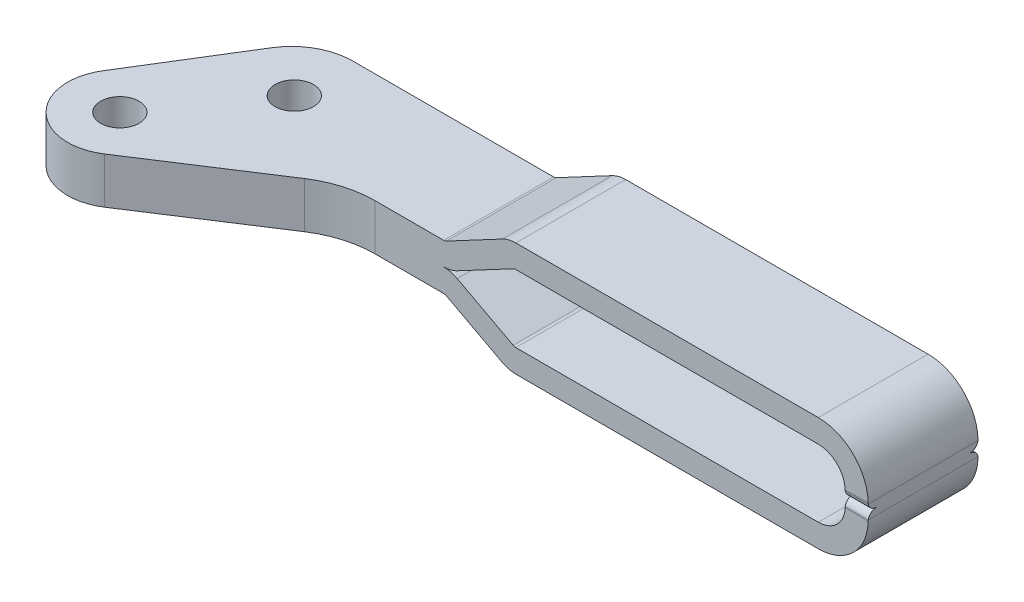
ISO-10303-21;
HEADER;
FILE_DESCRIPTION(('STEP AP214'),'2;1');
FILE_NAME('part.step','',(''),(''),'','','');
FILE_SCHEMA(('AUTOMOTIVE_DESIGN { 1 0 10303 214 1 1 1 1 }'));
ENDSEC;
DATA;
#1=APPLICATION_CONTEXT('core data for automotive mechanical design processes');
#2=APPLICATION_PROTOCOL_DEFINITION('international standard','automotive_design',2000,#1);
#3=PRODUCT_CONTEXT('',#1,'mechanical');
#4=PRODUCT('Part','Part','',(#3));
#5=PRODUCT_RELATED_PRODUCT_CATEGORY('part','',(#4));
#6=PRODUCT_DEFINITION_FORMATION('','',#4);
#7=PRODUCT_DEFINITION_CONTEXT('part definition',#1,'design');
#8=PRODUCT_DEFINITION('design','',#6,#7);
#9=PRODUCT_DEFINITION_SHAPE('','',#8);
#10=(LENGTH_UNIT() NAMED_UNIT(*) SI_UNIT(.MILLI.,.METRE.));
#11=(NAMED_UNIT(*) PLANE_ANGLE_UNIT() SI_UNIT($,.RADIAN.));
#12=(NAMED_UNIT(*) SI_UNIT($,.STERADIAN.) SOLID_ANGLE_UNIT());
#13=UNCERTAINTY_MEASURE_WITH_UNIT(LENGTH_MEASURE(1.E-05),#10,'distance_accuracy_value','');
#14=(GEOMETRIC_REPRESENTATION_CONTEXT(3) GLOBAL_UNCERTAINTY_ASSIGNED_CONTEXT((#13)) GLOBAL_UNIT_ASSIGNED_CONTEXT((#10,
#11,#12)) REPRESENTATION_CONTEXT('',''));
#15=CARTESIAN_POINT('',(0.,0.,0.));
#16=DIRECTION('',(0.,0.,1.));
#17=DIRECTION('',(1.,0.,0.));
#18=AXIS2_PLACEMENT_3D('',#15,#16,#17);
#19=CARTESIAN_POINT('',(87.7892596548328,1.027012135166,-7.64427190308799));
#20=DIRECTION('',(1.,0.,0.));
#21=DIRECTION('',(0.,1.,0.));
#22=AXIS2_PLACEMENT_3D('',#19,#20,#21);
#23=CYLINDRICAL_SURFACE('',#22,1.);
#24=CARTESIAN_POINT('',(87.789259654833,1.027012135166,-7.64427190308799));
#25=DIRECTION('',(1.,0.,0.));
#26=DIRECTION('',(0.,1.,0.));
#27=AXIS2_PLACEMENT_3D('',#24,#25,#26);
#28=CIRCLE('',#27,1.);
#29=CARTESIAN_POINT('',(87.789259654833,0.900021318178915,-6.65236801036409));
#30=VERTEX_POINT('',#29);
#31=CARTESIAN_POINT('',(87.7892596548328,0.0270121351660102,-7.64427190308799));
#32=VERTEX_POINT('',#31);
#33=EDGE_CURVE('E267',#30,#32,#28,.T.);
#34=ORIENTED_EDGE('',*,*,#33,.T.);
#35=DIRECTION('',(-1.,0.,0.));
#36=VECTOR('',#35,1.);
#37=CARTESIAN_POINT('',(87.7892596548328,0.0270121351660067,-7.64427190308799));
#38=LINE('',#37,#36);
#39=CARTESIAN_POINT('',(90.7892596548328,0.027012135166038,-7.64427190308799));
#40=VERTEX_POINT('',#39);
#41=EDGE_CURVE('E510',#32,#40,#38,.F.);
#42=ORIENTED_EDGE('',*,*,#41,.T.);
#43=CARTESIAN_POINT('',(90.7892596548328,1.027012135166,-7.64427190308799));
#44=DIRECTION('',(1.,0.,0.));
#45=DIRECTION('',(0.,1.,0.));
#46=AXIS2_PLACEMENT_3D('',#43,#44,#45);
#47=CIRCLE('',#46,1.);
#48=CARTESIAN_POINT('',(90.7892596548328,0.900021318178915,-6.65236801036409));
#49=VERTEX_POINT('',#48);
#50=EDGE_CURVE('E547',#40,#49,#47,.F.);
#51=ORIENTED_EDGE('',*,*,#50,.T.);
#52=DIRECTION('',(-1.,0.,0.));
#53=VECTOR('',#52,1.);
#54=CARTESIAN_POINT('',(89.289259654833,0.900021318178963,-6.65236801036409));
#55=LINE('',#54,#53);
#56=EDGE_CURVE('E453',#49,#30,#55,.T.);
#57=ORIENTED_EDGE('',*,*,#56,.T.);
#58=EDGE_LOOP('',(#34,#42,#51,#57));
#59=FACE_BOUND('',#58,.T.);
#60=ADVANCED_FACE('F14',(#59),#23,.T.);
#61=CARTESIAN_POINT('',(87.7892596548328,84.6911769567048,-12.9442719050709));
#62=DIRECTION('',(-1.,0.,0.));
#63=DIRECTION('',(0.,-1.,0.));
#64=AXIS2_PLACEMENT_3D('',#61,#62,#63);
#65=PLANE('',#64);
#66=CARTESIAN_POINT('',(87.7892596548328,1.02701213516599,-19.9442719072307));
#67=DIRECTION('',(1.,0.,0.));
#68=DIRECTION('',(0.,1.,0.));
#69=AXIS2_PLACEMENT_3D('',#66,#67,#68);
#70=CIRCLE('',#69,1.);
#71=CARTESIAN_POINT('',(87.7892596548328,0.0270121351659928,-19.9442719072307));
#72=VERTEX_POINT('',#71);
#73=CARTESIAN_POINT('',(87.789259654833,0.900021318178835,-20.9361757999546));
#74=VERTEX_POINT('',#73);
#75=EDGE_CURVE('E549',#72,#74,#70,.T.);
#76=ORIENTED_EDGE('',*,*,#75,.F.);
#77=DIRECTION('',(0.,-1.,0.));
#78=VECTOR('',#77,1.);
#79=CARTESIAN_POINT('',(87.7892596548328,12.6875808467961,-19.9442719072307));
#80=LINE('',#79,#78);
#81=CARTESIAN_POINT('',(87.7892596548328,-0.0270121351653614,-19.9442719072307));
#82=VERTEX_POINT('',#81);
#83=EDGE_CURVE('E716',#72,#82,#80,.T.);
#84=ORIENTED_EDGE('',*,*,#83,.T.);
#85=CARTESIAN_POINT('',(87.7892596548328,-1.02701213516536,-19.9442719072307));
#86=DIRECTION('',(-1.,0.,0.));
#87=DIRECTION('',(0.,-1.,0.));
#88=AXIS2_PLACEMENT_3D('',#85,#86,#87);
#89=CIRCLE('',#88,1.);
#90=CARTESIAN_POINT('',(87.7892596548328,-0.900021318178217,-20.9361757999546));
#91=VERTEX_POINT('',#90);
#92=EDGE_CURVE('E319',#91,#82,#89,.F.);
#93=ORIENTED_EDGE('',*,*,#92,.F.);
#94=DIRECTION('',(0.,0.,1.));
#95=VECTOR('',#94,1.);
#96=CARTESIAN_POINT('',(87.7892596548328,-0.900021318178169,-30.3826722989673));
#97=LINE('',#96,#95);
#98=CARTESIAN_POINT('',(87.7892596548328,-0.90002131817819,-6.65236801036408));
#99=VERTEX_POINT('',#98);
#100=EDGE_CURVE('E262',#91,#99,#97,.T.);
#101=ORIENTED_EDGE('',*,*,#100,.T.);
#102=CARTESIAN_POINT('',(87.7892596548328,-1.02701213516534,-7.64427190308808));
#103=DIRECTION('',(-1.,0.,0.));
#104=DIRECTION('',(0.,-1.,0.));
#105=AXIS2_PLACEMENT_3D('',#102,#103,#104);
#106=CIRCLE('',#105,1.);
#107=CARTESIAN_POINT('',(87.7892596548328,-0.0270121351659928,-7.64427190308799));
#108=VERTEX_POINT('',#107);
#109=EDGE_CURVE('E317',#108,#99,#106,.F.);
#110=ORIENTED_EDGE('',*,*,#109,.F.);
#111=DIRECTION('',(0.,-1.,0.));
#112=VECTOR('',#111,1.);
#113=CARTESIAN_POINT('',(87.7892596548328,12.6875808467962,-7.64427190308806));
#114=LINE('',#113,#112);
#115=EDGE_CURVE('E712',#32,#108,#114,.T.);
#116=ORIENTED_EDGE('',*,*,#115,.F.);
#117=ORIENTED_EDGE('',*,*,#33,.F.);
#118=DIRECTION('',(0.,0.,1.));
#119=VECTOR('',#118,1.);
#120=CARTESIAN_POINT('',(87.789259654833,0.900021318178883,-30.3826722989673));
#121=LINE('',#120,#119);
#122=EDGE_CURVE('E537',#30,#74,#121,.F.);
#123=ORIENTED_EDGE('',*,*,#122,.T.);
#124=EDGE_LOOP('',(#76,#84,#93,#101,#110,#116,#117,#123));
#125=FACE_BOUND('',#124,.T.);
#126=ADVANCED_FACE('F478',(#125),#65,.T.);
#127=CARTESIAN_POINT('',(87.7892596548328,1.02701213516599,-19.9442719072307));
#128=DIRECTION('',(1.,0.,0.));
#129=DIRECTION('',(0.,1.,0.));
#130=AXIS2_PLACEMENT_3D('',#127,#128,#129);
#131=CYLINDRICAL_SURFACE('',#130,1.);
#132=CARTESIAN_POINT('',(90.7892596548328,1.02701213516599,-19.9442719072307));
#133=DIRECTION('',(1.,0.,0.));
#134=DIRECTION('',(0.,1.,0.));
#135=AXIS2_PLACEMENT_3D('',#132,#133,#134);
#136=CIRCLE('',#135,1.);
#137=CARTESIAN_POINT('',(90.7892596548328,0.900021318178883,-20.9361757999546));
#138=VERTEX_POINT('',#137);
#139=CARTESIAN_POINT('',(90.7892596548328,0.0270121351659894,-19.9442719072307));
#140=VERTEX_POINT('',#139);
#141=EDGE_CURVE('E511',#138,#140,#136,.F.);
#142=ORIENTED_EDGE('',*,*,#141,.T.);
#143=DIRECTION('',(-1.,0.,0.));
#144=VECTOR('',#143,1.);
#145=CARTESIAN_POINT('',(87.7892596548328,0.0270121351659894,-19.9442719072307));
#146=LINE('',#145,#144);
#147=EDGE_CURVE('E507',#140,#72,#146,.T.);
#148=ORIENTED_EDGE('',*,*,#147,.T.);
#149=ORIENTED_EDGE('',*,*,#75,.T.);
#150=DIRECTION('',(1.,0.,0.));
#151=VECTOR('',#150,1.);
#152=CARTESIAN_POINT('',(89.289259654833,0.900021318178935,-20.9361757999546));
#153=LINE('',#152,#151);
#154=EDGE_CURVE('E452',#74,#138,#153,.T.);
#155=ORIENTED_EDGE('',*,*,#154,.T.);
#156=EDGE_LOOP('',(#142,#148,#149,#155));
#157=FACE_BOUND('',#156,.T.);
#158=ADVANCED_FACE('F481',(#157),#131,.T.);
#159=CARTESIAN_POINT('',(90.7892596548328,84.6911769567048,-12.9442719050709));
#160=DIRECTION('',(-1.,0.,0.));
#161=DIRECTION('',(0.,-1.,0.));
#162=AXIS2_PLACEMENT_3D('',#159,#160,#161);
#163=PLANE('',#162);
#164=DIRECTION('',(0.,0.,1.));
#165=VECTOR('',#164,1.);
#166=CARTESIAN_POINT('',(90.789259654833,0.900021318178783,-30.3826722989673));
#167=LINE('',#166,#165);
#168=EDGE_CURVE('E499',#49,#138,#167,.F.);
#169=ORIENTED_EDGE('',*,*,#168,.F.);
#170=ORIENTED_EDGE('',*,*,#50,.F.);
#171=DIRECTION('',(0.,-1.,0.));
#172=VECTOR('',#171,1.);
#173=CARTESIAN_POINT('',(90.7892596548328,12.6875808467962,-7.64427190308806));
#174=LINE('',#173,#172);
#175=CARTESIAN_POINT('',(90.7892596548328,-0.0270121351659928,-7.64427190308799));
#176=VERTEX_POINT('',#175);
#177=EDGE_CURVE('E331',#40,#176,#174,.T.);
#178=ORIENTED_EDGE('',*,*,#177,.T.);
#179=CARTESIAN_POINT('',(90.7892596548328,-1.02701213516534,-7.64427190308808));
#180=DIRECTION('',(-1.,0.,0.));
#181=DIRECTION('',(0.,-1.,0.));
#182=AXIS2_PLACEMENT_3D('',#179,#180,#181);
#183=CIRCLE('',#182,1.);
#184=CARTESIAN_POINT('',(90.7892596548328,-0.90002131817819,-6.65236801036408));
#185=VERTEX_POINT('',#184);
#186=EDGE_CURVE('E219',#185,#176,#183,.T.);
#187=ORIENTED_EDGE('',*,*,#186,.F.);
#188=DIRECTION('',(0.,0.,1.));
#189=VECTOR('',#188,1.);
#190=CARTESIAN_POINT('',(90.7892596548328,-0.900021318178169,-30.3826722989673));
#191=LINE('',#190,#189);
#192=CARTESIAN_POINT('',(90.7892596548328,-0.900021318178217,-20.9361757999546));
#193=VERTEX_POINT('',#192);
#194=EDGE_CURVE('E240',#193,#185,#191,.T.);
#195=ORIENTED_EDGE('',*,*,#194,.F.);
#196=CARTESIAN_POINT('',(90.7892596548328,-1.02701213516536,-19.9442719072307));
#197=DIRECTION('',(-1.,0.,0.));
#198=DIRECTION('',(0.,-1.,0.));
#199=AXIS2_PLACEMENT_3D('',#196,#197,#198);
#200=CIRCLE('',#199,1.);
#201=CARTESIAN_POINT('',(90.7892596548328,-0.0270121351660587,-19.9442719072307));
#202=VERTEX_POINT('',#201);
#203=EDGE_CURVE('E20',#202,#193,#200,.T.);
#204=ORIENTED_EDGE('',*,*,#203,.F.);
#205=DIRECTION('',(0.,-1.,0.));
#206=VECTOR('',#205,1.);
#207=CARTESIAN_POINT('',(90.7892596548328,12.6875808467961,-19.9442719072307));
#208=LINE('',#207,#206);
#209=EDGE_CURVE('E705',#140,#202,#208,.T.);
#210=ORIENTED_EDGE('',*,*,#209,.F.);
#211=ORIENTED_EDGE('',*,*,#141,.F.);
#212=EDGE_LOOP('',(#169,#170,#178,#187,#195,#204,#210,#211));
#213=FACE_BOUND('',#212,.T.);
#214=ADVANCED_FACE('F250',(#213),#163,.F.);
#215=CARTESIAN_POINT('',(90.7892596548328,-1.02701213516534,-7.64427190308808));
#216=DIRECTION('',(-1.,0.,0.));
#217=DIRECTION('',(0.,-1.,0.));
#218=AXIS2_PLACEMENT_3D('',#215,#216,#217);
#219=CYLINDRICAL_SURFACE('',#218,1.);
#220=DIRECTION('',(1.,0.,0.));
#221=VECTOR('',#220,1.);
#222=CARTESIAN_POINT('',(90.7892596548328,-0.027012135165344,-7.64427190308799));
#223=LINE('',#222,#221);
#224=EDGE_CURVE('E256',#176,#108,#223,.F.);
#225=ORIENTED_EDGE('',*,*,#224,.T.);
#226=ORIENTED_EDGE('',*,*,#109,.T.);
#227=DIRECTION('',(-1.,0.,0.));
#228=VECTOR('',#227,1.);
#229=CARTESIAN_POINT('',(89.2892596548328,-0.900021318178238,-6.65236801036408));
#230=LINE('',#229,#228);
#231=EDGE_CURVE('E247',#185,#99,#230,.T.);
#232=ORIENTED_EDGE('',*,*,#231,.F.);
#233=ORIENTED_EDGE('',*,*,#186,.T.);
#234=EDGE_LOOP('',(#225,#226,#232,#233));
#235=FACE_BOUND('',#234,.T.);
#236=ADVANCED_FACE('F322',(#235),#219,.T.);
#237=CARTESIAN_POINT('',(90.7892596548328,-1.02701213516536,-19.9442719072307));
#238=DIRECTION('',(-1.,0.,0.));
#239=DIRECTION('',(0.,-1.,0.));
#240=AXIS2_PLACEMENT_3D('',#237,#238,#239);
#241=CYLINDRICAL_SURFACE('',#240,1.);
#242=DIRECTION('',(1.,0.,0.));
#243=VECTOR('',#242,1.);
#244=CARTESIAN_POINT('',(90.7892596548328,-0.0270121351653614,-19.9442719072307));
#245=LINE('',#244,#243);
#246=EDGE_CURVE('E232',#82,#202,#245,.T.);
#247=ORIENTED_EDGE('',*,*,#246,.T.);
#248=ORIENTED_EDGE('',*,*,#203,.T.);
#249=DIRECTION('',(1.,0.,0.));
#250=VECTOR('',#249,1.);
#251=CARTESIAN_POINT('',(89.2892596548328,-0.900021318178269,-20.9361757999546));
#252=LINE('',#251,#250);
#253=EDGE_CURVE('E229',#91,#193,#252,.T.);
#254=ORIENTED_EDGE('',*,*,#253,.F.);
#255=ORIENTED_EDGE('',*,*,#92,.T.);
#256=EDGE_LOOP('',(#247,#248,#254,#255));
#257=FACE_BOUND('',#256,.T.);
#258=ADVANCED_FACE('F226',(#257),#241,.T.);
#259=CARTESIAN_POINT('',(90.789259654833,0.900021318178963,-6.65236801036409));
#260=CARTESIAN_POINT('',(90.789259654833,0.954749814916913,-6.64765389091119));
#261=CARTESIAN_POINT('',(90.788568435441,1.00977926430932,-6.64495518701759));
#262=CARTESIAN_POINT('',(90.7871633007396,1.06509163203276,-6.64427190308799));
#263=CARTESIAN_POINT('',(87.789259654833,0.900021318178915,-6.65236801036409));
#264=CARTESIAN_POINT('',(87.789259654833,0.929490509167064,-6.64765389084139));
#265=CARTESIAN_POINT('',(87.7888874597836,0.959121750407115,-6.64495518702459));
#266=CARTESIAN_POINT('',(87.7881308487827,0.988905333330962,-6.64427190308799));
#267=B_SPLINE_SURFACE_WITH_KNOTS('',1,3,((#259,#260,#261,#262),(#263,#264,#265,#266)),
.UNSPECIFIED.,.F.,.F.,.F.,(2,2),(4,4),(0.,1.),(0.,1.),.UNSPECIFIED.);
#268=CARTESIAN_POINT('',(90.7871633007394,1.06509163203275,-6.64427190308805));
#269=CARTESIAN_POINT('',(90.7873388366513,1.05818180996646,-6.64435730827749));
#270=CARTESIAN_POINT('',(90.7875033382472,1.0512720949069,-6.64447421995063));
#271=CARTESIAN_POINT('',(90.7878100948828,1.03746157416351,-6.64477108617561));
#272=CARTESIAN_POINT('',(90.7879523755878,1.03056076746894,-6.64495096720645));
#273=CARTESIAN_POINT('',(90.7882147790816,1.01676813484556,-6.64537377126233));
#274=CARTESIAN_POINT('',(90.788334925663,1.00987630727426,-6.64561662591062));
#275=CARTESIAN_POINT('',(90.7885531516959,0.996101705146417,-6.64616537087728));
#276=CARTESIAN_POINT('',(90.7886512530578,0.989218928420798,-6.6464711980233));
#277=CARTESIAN_POINT('',(90.7888254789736,0.975462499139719,-6.64714588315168));
#278=CARTESIAN_POINT('',(90.7889016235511,0.968588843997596,-6.64751468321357));
#279=CARTESIAN_POINT('',(90.7890320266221,0.954850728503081,-6.64831530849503));
#280=CARTESIAN_POINT('',(90.7890863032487,0.947986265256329,-6.64874708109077));
#281=CARTESIAN_POINT('',(90.7891730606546,0.934266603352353,-6.64967364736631));
#282=CARTESIAN_POINT('',(90.7892055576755,0.927411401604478,-6.65016839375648));
#283=CARTESIAN_POINT('',(90.7892488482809,0.913710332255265,-6.65122089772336));
#284=CARTESIAN_POINT('',(90.7892596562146,0.906864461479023,-6.6517786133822));
#285=CARTESIAN_POINT('',(90.789259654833,0.90002131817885,-6.6523680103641));
#286=B_SPLINE_CURVE_WITH_KNOTS('',3,(#268,#269,#270,#271,#272,#273,#274,#275,#276,#277,#278,
#279,#280,#281,#282,#283,#284,#285),.UNSPECIFIED.,.F.,.F.,(4,2,2,2,2,2,2,2,4),(0.,
0.0207376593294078,0.0414511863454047,0.0621423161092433,0.0828127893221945,0.103464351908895,
0.124098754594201,0.144717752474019,0.16532310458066),.UNSPECIFIED.);
#287=CARTESIAN_POINT('',(90.7871633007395,1.06509163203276,-6.64427190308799));
#288=VERTEX_POINT('',#287);
#289=EDGE_CURVE('E490',#288,#49,#286,.T.);
#290=DIRECTION('',(-0.999677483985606,-0.0253954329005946,0.));
#291=VECTOR('',#290,1.);
#292=CARTESIAN_POINT('',(90.7871633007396,1.06509163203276,-6.64427190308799));
#293=LINE('',#292,#291);
#294=CARTESIAN_POINT('',(87.7881308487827,0.988905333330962,-6.64427190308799));
#295=VERTEX_POINT('',#294);
#296=EDGE_CURVE('E498',#288,#295,#293,.T.);
#297=CARTESIAN_POINT('',(87.7881308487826,0.988905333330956,-6.64427190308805));
#298=CARTESIAN_POINT('',(87.7882253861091,0.985184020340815,-6.64435731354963));
#299=CARTESIAN_POINT('',(87.7883139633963,0.9814632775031,-6.64447424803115));
#300=CARTESIAN_POINT('',(87.7884791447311,0.974026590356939,-6.64477112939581));
#301=CARTESIAN_POINT('',(87.7885557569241,0.970310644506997,-6.64495103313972));
#302=CARTESIAN_POINT('',(87.7886970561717,0.962883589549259,-6.64537385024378));
#303=CARTESIAN_POINT('',(87.7887617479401,0.959172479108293,-6.64561673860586));
#304=CARTESIAN_POINT('',(87.7888792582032,0.951755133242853,-6.64616550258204));
#305=CARTESIAN_POINT('',(87.7889320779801,0.948048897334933,-6.64647137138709));
#306=CARTESIAN_POINT('',(87.7890258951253,0.940641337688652,-6.64714607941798));
#307=CARTESIAN_POINT('',(87.7890668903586,0.936940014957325,-6.64751492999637));
#308=CARTESIAN_POINT('',(87.789137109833,0.929542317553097,-6.64831558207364));
#309=CARTESIAN_POINT('',(87.7891663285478,0.925845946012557,-6.64874741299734));
#310=CARTESIAN_POINT('',(87.7892130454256,0.918458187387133,-6.64967401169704));
#311=CARTESIAN_POINT('',(87.7892305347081,0.914766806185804,-6.65016882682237));
#312=CARTESIAN_POINT('',(87.7892538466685,0.907389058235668,-6.65122136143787));
#313=CARTESIAN_POINT('',(87.789259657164,0.90370270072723,-6.65177914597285));
#314=CARTESIAN_POINT('',(87.789259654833,0.900021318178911,-6.6523680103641));
#315=B_SPLINE_CURVE_WITH_KNOTS('',3,(#297,#298,#299,#300,#301,#302,#303,#304,#305,#306,#307,
#308,#309,#310,#311,#312,#313,#314),.UNSPECIFIED.,.F.,.F.,(4,2,2,2,2,2,2,2,4),(0.,
0.0111703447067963,0.0223330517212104,0.0334913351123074,0.0446484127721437,0.055807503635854,
0.0669718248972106,0.0781445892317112,0.0893290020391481),.UNSPECIFIED.);
#316=EDGE_CURVE('E454',#30,#295,#315,.F.);
#317=ORIENTED_EDGE('',*,*,#289,.F.);
#318=ORIENTED_EDGE('',*,*,#296,.T.);
#319=ORIENTED_EDGE('',*,*,#316,.F.);
#320=ORIENTED_EDGE('',*,*,#56,.F.);
#321=EDGE_LOOP('',(#317,#318,#319,#320));
#322=FACE_BOUND('',#321,.T.);
#323=ADVANCED_FACE('F998',(#322),#267,.F.);
#324=CARTESIAN_POINT('',(35.5222243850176,3.73660000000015,0.857849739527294));
#325=DIRECTION('',(0.,0.,-1.));
#326=DIRECTION('',(0.,1.,0.));
#327=AXIS2_PLACEMENT_3D('',#324,#325,#326);
#328=CYLINDRICAL_SURFACE('',#327,3.7366);
#329=DIRECTION('',(0.,0.,-1.));
#330=VECTOR('',#329,1.);
#331=CARTESIAN_POINT('',(37.2764518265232,0.437378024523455,0.857849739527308));
#332=LINE('',#331,#330);
#333=CARTESIAN_POINT('',(37.2764518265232,0.437378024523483,-20.9442719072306));
#334=VERTEX_POINT('',#333);
#335=CARTESIAN_POINT('',(37.2764518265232,0.437378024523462,-6.64427190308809));
#336=VERTEX_POINT('',#335);
#337=EDGE_CURVE('E402',#334,#336,#332,.F.);
#338=ORIENTED_EDGE('',*,*,#337,.T.);
#339=CARTESIAN_POINT('',(35.5222243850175,3.73660000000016,-6.64427190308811));
#340=DIRECTION('',(0.,0.,-1.));
#341=DIRECTION('',(0.,1.,0.));
#342=AXIS2_PLACEMENT_3D('',#339,#340,#341);
#343=CIRCLE('',#342,3.7366);
#344=CARTESIAN_POINT('',(35.5222243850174,1.11022302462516E-13,-6.64427190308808));
#345=VERTEX_POINT('',#344);
#346=EDGE_CURVE('E370',#336,#345,#343,.T.);
#347=ORIENTED_EDGE('',*,*,#346,.T.);
#348=DIRECTION('',(0.,0.,1.));
#349=VECTOR('',#348,1.);
#350=CARTESIAN_POINT('',(35.5222243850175,0.,-12.9442719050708));
#351=LINE('',#350,#349);
#352=CARTESIAN_POINT('',(35.5222243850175,0.,-20.9442719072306));
#353=VERTEX_POINT('',#352);
#354=EDGE_CURVE('E9',#353,#345,#351,.T.);
#355=ORIENTED_EDGE('',*,*,#354,.F.);
#356=CARTESIAN_POINT('',(35.5222243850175,3.73660000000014,-20.9442719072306));
#357=DIRECTION('',(0.,0.,-1.));
#358=DIRECTION('',(0.,1.,0.));
#359=AXIS2_PLACEMENT_3D('',#356,#357,#358);
#360=CIRCLE('',#359,3.7366);
#361=EDGE_CURVE('E393',#353,#334,#360,.F.);
#362=ORIENTED_EDGE('',*,*,#361,.T.);
#363=EDGE_LOOP('',(#338,#347,#355,#362));
#364=FACE_BOUND('',#363,.T.);
#365=ADVANCED_FACE('F674',(#364),#328,.T.);
#366=CARTESIAN_POINT('',(13.2508568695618,-12.3372574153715,-12.9442719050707));
#367=DIRECTION('',(0.469471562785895,-0.882947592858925,0.));
#368=DIRECTION('',(0.882947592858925,0.469471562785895,0.));
#369=AXIS2_PLACEMENT_3D('',#366,#367,#368);
#370=PLANE('',#369);
#371=DIRECTION('',(0.882947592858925,0.469471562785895,0.));
#372=VECTOR('',#371,1.);
#373=CARTESIAN_POINT('',(13.2508568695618,-12.3372574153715,-6.64427190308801));
#374=LINE('',#373,#372);
#375=CARTESIAN_POINT('',(44.5669421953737,4.31380051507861,-6.64427190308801));
#376=VERTEX_POINT('',#375);
#377=EDGE_CURVE('E405',#376,#336,#374,.F.);
#378=ORIENTED_EDGE('',*,*,#377,.T.);
#379=ORIENTED_EDGE('',*,*,#337,.F.);
#380=DIRECTION('',(0.882947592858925,0.469471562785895,0.));
#381=VECTOR('',#380,1.);
#382=CARTESIAN_POINT('',(13.2508568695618,-12.3372574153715,-20.9442719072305));
#383=LINE('',#382,#381);
#384=CARTESIAN_POINT('',(44.5669421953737,4.31380051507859,-20.9442719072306));
#385=VERTEX_POINT('',#384);
#386=EDGE_CURVE('E409',#334,#385,#383,.T.);
#387=ORIENTED_EDGE('',*,*,#386,.T.);
#388=DIRECTION('',(0.,0.,1.));
#389=VECTOR('',#388,1.);
#390=CARTESIAN_POINT('',(44.5669421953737,4.31380051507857,-12.9442719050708));
#391=LINE('',#390,#389);
#392=EDGE_CURVE('E408',#385,#376,#391,.T.);
#393=ORIENTED_EDGE('',*,*,#392,.T.);
#394=EDGE_LOOP('',(#378,#379,#387,#393));
#395=FACE_BOUND('',#394,.T.);
#396=ADVANCED_FACE('F677',(#395),#370,.T.);
#397=CARTESIAN_POINT('',(44.912754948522,3.66342131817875,0.857849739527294));
#398=DIRECTION('',(0.,0.,-1.));
#399=DIRECTION('',(0.,1.,0.));
#400=AXIS2_PLACEMENT_3D('',#397,#398,#399);
#401=CYLINDRICAL_SURFACE('',#400,0.7366);
#402=CARTESIAN_POINT('',(44.9127549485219,3.66342131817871,-6.64427190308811));
#403=DIRECTION('',(0.,0.,-1.));
#404=DIRECTION('',(0.,1.,0.));
#405=AXIS2_PLACEMENT_3D('',#402,#403,#404);
#406=CIRCLE('',#405,0.7366);
#407=CARTESIAN_POINT('',(44.9127549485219,4.40002131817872,-6.64427190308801));
#408=VERTEX_POINT('',#407);
#409=EDGE_CURVE('E433',#376,#408,#406,.T.);
#410=ORIENTED_EDGE('',*,*,#409,.F.);
#411=ORIENTED_EDGE('',*,*,#392,.F.);
#412=CARTESIAN_POINT('',(44.9127549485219,3.66342131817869,-20.9442719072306));
#413=DIRECTION('',(0.,0.,-1.));
#414=DIRECTION('',(0.,1.,0.));
#415=AXIS2_PLACEMENT_3D('',#412,#413,#414);
#416=CIRCLE('',#415,0.7366);
#417=CARTESIAN_POINT('',(44.9127549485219,4.40002131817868,-20.9442719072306));
#418=VERTEX_POINT('',#417);
#419=EDGE_CURVE('E424',#418,#385,#416,.F.);
#420=ORIENTED_EDGE('',*,*,#419,.F.);
#421=DIRECTION('',(0.,0.,-1.));
#422=VECTOR('',#421,1.);
#423=CARTESIAN_POINT('',(44.912754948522,4.40002131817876,0.857849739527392));
#424=LINE('',#423,#422);
#425=EDGE_CURVE('E419',#408,#418,#424,.T.);
#426=ORIENTED_EDGE('',*,*,#425,.F.);
#427=EDGE_LOOP('',(#410,#411,#420,#426));
#428=FACE_BOUND('',#427,.T.);
#429=ADVANCED_FACE('F681',(#428),#401,.F.);
#430=CARTESIAN_POINT('',(8.35208565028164,4.40002131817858,-12.9442719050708));
#431=DIRECTION('',(0.,-1.,0.));
#432=DIRECTION('',(1.,0.,0.));
#433=AXIS2_PLACEMENT_3D('',#430,#431,#432);
#434=PLANE('',#433);
#435=DIRECTION('',(1.,0.,0.));
#436=VECTOR('',#435,1.);
#437=CARTESIAN_POINT('',(8.35208565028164,4.40002131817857,-6.64427190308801));
#438=LINE('',#437,#436);
#439=CARTESIAN_POINT('',(84.289259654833,4.40002131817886,-6.64427190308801));
#440=VERTEX_POINT('',#439);
#441=EDGE_CURVE('E426',#440,#408,#438,.F.);
#442=ORIENTED_EDGE('',*,*,#441,.T.);
#443=ORIENTED_EDGE('',*,*,#425,.T.);
#444=DIRECTION('',(1.,0.,0.));
#445=VECTOR('',#444,1.);
#446=CARTESIAN_POINT('',(8.35208565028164,4.40002131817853,-20.9442719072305));
#447=LINE('',#446,#445);
#448=CARTESIAN_POINT('',(84.289259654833,4.40002131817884,-20.9442719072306));
#449=VERTEX_POINT('',#448);
#450=EDGE_CURVE('E434',#418,#449,#447,.T.);
#451=ORIENTED_EDGE('',*,*,#450,.T.);
#452=DIRECTION('',(0.,0.,1.));
#453=VECTOR('',#452,1.);
#454=CARTESIAN_POINT('',(84.289259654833,4.40002131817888,-12.9442719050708));
#455=LINE('',#454,#453);
#456=EDGE_CURVE('E430',#449,#440,#455,.T.);
#457=ORIENTED_EDGE('',*,*,#456,.T.);
#458=EDGE_LOOP('',(#442,#443,#451,#457));
#459=FACE_BOUND('',#458,.T.);
#460=ADVANCED_FACE('F468',(#459),#434,.T.);
#461=CARTESIAN_POINT('',(84.289259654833,0.900021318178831,-30.3826722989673));
#462=DIRECTION('',(0.,0.,1.));
#463=DIRECTION('',(0.,-1.,0.));
#464=AXIS2_PLACEMENT_3D('',#461,#462,#463);
#465=CYLINDRICAL_SURFACE('',#464,3.5);
#466=CARTESIAN_POINT('',(84.289259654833,0.900021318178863,-6.64427190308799));
#467=DIRECTION('',(0.,0.,1.));
#468=DIRECTION('',(0.,-1.,0.));
#469=AXIS2_PLACEMENT_3D('',#466,#467,#468);
#470=CIRCLE('',#469,3.5);
#471=EDGE_CURVE('E445',#440,#295,#470,.F.);
#472=ORIENTED_EDGE('',*,*,#471,.F.);
#473=ORIENTED_EDGE('',*,*,#456,.F.);
#474=CARTESIAN_POINT('',(84.289259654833,0.900021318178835,-20.9442719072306));
#475=DIRECTION('',(0.,0.,1.));
#476=DIRECTION('',(0.,-1.,0.));
#477=AXIS2_PLACEMENT_3D('',#474,#475,#476);
#478=CIRCLE('',#477,3.5);
#479=CARTESIAN_POINT('',(87.7881308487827,0.988905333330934,-20.9442719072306));
#480=VERTEX_POINT('',#479);
#481=EDGE_CURVE('E535',#480,#449,#478,.T.);
#482=ORIENTED_EDGE('',*,*,#481,.F.);
#483=CARTESIAN_POINT('',(87.789259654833,0.900021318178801,-20.9361757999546));
#484=CARTESIAN_POINT('',(87.789259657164,0.903702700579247,-20.9367646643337));
#485=CARTESIAN_POINT('',(87.789253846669,0.907389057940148,-20.9373224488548));
#486=CARTESIAN_POINT('',(87.7892305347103,0.914766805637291,-20.9383749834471));
#487=CARTESIAN_POINT('',(87.7892130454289,0.918458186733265,-20.9388697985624));
#488=CARTESIAN_POINT('',(87.7891663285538,0.92584594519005,-20.9397963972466));
#489=CARTESIAN_POINT('',(87.7891371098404,0.929542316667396,-20.9402282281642));
#490=CARTESIAN_POINT('',(87.7890668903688,0.936940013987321,-20.9410288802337));
#491=CARTESIAN_POINT('',(87.7890258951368,0.940641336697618,-20.9413977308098));
#492=CARTESIAN_POINT('',(87.7889320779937,0.948048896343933,-20.9420724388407));
#493=CARTESIAN_POINT('',(87.7888792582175,0.951755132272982,-20.9423783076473));
#494=CARTESIAN_POINT('',(87.7887617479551,0.959172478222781,-20.9429270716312));
#495=CARTESIAN_POINT('',(87.7886970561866,0.96288358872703,-20.9431699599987));
#496=CARTESIAN_POINT('',(87.7885557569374,0.970310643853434,-20.9435927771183));
#497=CARTESIAN_POINT('',(87.7884791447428,0.974026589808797,-20.9437726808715));
#498=CARTESIAN_POINT('',(87.7883139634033,0.981463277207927,-20.9440695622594));
#499=CARTESIAN_POINT('',(87.7882253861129,0.985184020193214,-20.9441864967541));
#500=CARTESIAN_POINT('',(87.7881308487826,0.988905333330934,-20.9442719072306));
#501=B_SPLINE_CURVE_WITH_KNOTS('',3,(#483,#484,#485,#486,#487,#488,#489,#490,#491,#492,#493,
#494,#495,#496,#497,#498,#499,#500),.UNSPECIFIED.,.F.,.F.,(4,2,2,2,2,2,2,2,4),(0.,
0.0111844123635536,0.0223571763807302,0.0335214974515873,0.0446805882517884,0.0558376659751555,
0.0669959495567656,0.0781586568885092,0.0893290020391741),.UNSPECIFIED.);
#502=EDGE_CURVE('E448',#480,#74,#501,.F.);
#503=ORIENTED_EDGE('',*,*,#502,.T.);
#504=ORIENTED_EDGE('',*,*,#122,.F.);
#505=ORIENTED_EDGE('',*,*,#316,.T.);
#506=EDGE_LOOP('',(#472,#473,#482,#503,#504,#505));
#507=FACE_BOUND('',#506,.T.);
#508=ADVANCED_FACE('F457',(#507),#465,.F.);
#509=CARTESIAN_POINT('',(90.7871633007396,1.06509163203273,-20.9442719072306));
#510=CARTESIAN_POINT('',(90.7885684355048,1.00977926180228,-20.9435886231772));
#511=CARTESIAN_POINT('',(90.789259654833,0.954749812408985,-20.9408899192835));
#512=CARTESIAN_POINT('',(90.789259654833,0.900021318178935,-20.9361757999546));
#513=CARTESIAN_POINT('',(87.7881308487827,0.988905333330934,-20.9442719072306));
#514=CARTESIAN_POINT('',(87.7888874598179,0.959121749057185,-20.9435886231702));
#515=CARTESIAN_POINT('',(87.789259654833,0.929490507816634,-20.9408899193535));
#516=CARTESIAN_POINT('',(87.789259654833,0.900021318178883,-20.9361757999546));
#517=B_SPLINE_SURFACE_WITH_KNOTS('',1,3,((#509,#510,#511,#512),(#513,#514,#515,#516)),
.UNSPECIFIED.,.F.,.F.,.F.,(2,2),(4,4),(0.,1.),(0.,1.),.UNSPECIFIED.);
#518=CARTESIAN_POINT('',(90.789259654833,0.900021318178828,-20.9361757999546));
#519=CARTESIAN_POINT('',(90.7892596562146,0.906864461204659,-20.9367651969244));
#520=CARTESIAN_POINT('',(90.7892488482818,0.913710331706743,-20.9373229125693));
#521=CARTESIAN_POINT('',(90.7892055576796,0.927411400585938,-20.938375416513));
#522=CARTESIAN_POINT('',(90.7891730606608,0.934266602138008,-20.9388701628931));
#523=CARTESIAN_POINT('',(90.7890863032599,0.947986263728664,-20.9397967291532));
#524=CARTESIAN_POINT('',(90.7890320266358,0.954850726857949,-20.9402285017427));
#525=CARTESIAN_POINT('',(90.7889016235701,0.968588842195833,-20.9410291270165));
#526=CARTESIAN_POINT('',(90.788825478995,0.975462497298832,-20.9413979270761));
#527=CARTESIAN_POINT('',(90.7886512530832,0.989218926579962,-20.9420726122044));
#528=CARTESIAN_POINT('',(90.7885531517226,0.996101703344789,-20.942378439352));
#529=CARTESIAN_POINT('',(90.7883349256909,1.00987630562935,-20.9429271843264));
#530=CARTESIAN_POINT('',(90.7882147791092,1.01676813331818,-20.9431700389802));
#531=CARTESIAN_POINT('',(90.7879523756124,1.0305607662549,-20.9435928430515));
#532=CARTESIAN_POINT('',(90.7878100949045,1.0374615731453,-20.9437727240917));
#533=CARTESIAN_POINT('',(90.7875033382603,1.05127209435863,-20.9440695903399));
#534=CARTESIAN_POINT('',(90.7873388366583,1.05818180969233,-20.9441865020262));
#535=CARTESIAN_POINT('',(90.7871633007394,1.06509163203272,-20.9442719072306));
#536=B_SPLINE_CURVE_WITH_KNOTS('',3,(#518,#519,#520,#521,#522,#523,#524,#525,#526,#527,#528,
#529,#530,#531,#532,#533,#534,#535),.UNSPECIFIED.,.F.,.F.,(4,2,2,2,2,2,2,2,4),(0.,
0.0206053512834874,0.0412243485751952,0.0618587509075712,0.0825103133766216,0.103180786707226,
0.123871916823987,0.144585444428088,0.165323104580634),.UNSPECIFIED.);
#537=CARTESIAN_POINT('',(90.7871633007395,1.06509163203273,-20.9442719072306));
#538=VERTEX_POINT('',#537);
#539=EDGE_CURVE('E494',#138,#538,#536,.T.);
#540=DIRECTION('',(0.999677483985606,0.0253954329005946,0.));
#541=VECTOR('',#540,1.);
#542=CARTESIAN_POINT('',(87.7881308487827,0.988905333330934,-20.9442719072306));
#543=LINE('',#542,#541);
#544=EDGE_CURVE('E541',#480,#538,#543,.T.);
#545=ORIENTED_EDGE('',*,*,#539,.F.);
#546=ORIENTED_EDGE('',*,*,#154,.F.);
#547=ORIENTED_EDGE('',*,*,#502,.F.);
#548=ORIENTED_EDGE('',*,*,#544,.T.);
#549=EDGE_LOOP('',(#545,#546,#547,#548));
#550=FACE_BOUND('',#549,.T.);
#551=ADVANCED_FACE('F467',(#550),#517,.F.);
#552=CARTESIAN_POINT('',(84.289259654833,0.900021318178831,-30.3826722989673));
#553=DIRECTION('',(0.,0.,1.));
#554=DIRECTION('',(0.,-1.,0.));
#555=AXIS2_PLACEMENT_3D('',#552,#553,#554);
#556=CYLINDRICAL_SURFACE('',#555,6.5);
#557=DIRECTION('',(0.,0.,1.));
#558=VECTOR('',#557,1.);
#559=CARTESIAN_POINT('',(84.289259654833,7.40002131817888,-12.9442719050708));
#560=LINE('',#559,#558);
#561=CARTESIAN_POINT('',(84.289259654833,7.40002131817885,-20.9442719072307));
#562=VERTEX_POINT('',#561);
#563=CARTESIAN_POINT('',(84.289259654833,7.40002131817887,-6.64427190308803));
#564=VERTEX_POINT('',#563);
#565=EDGE_CURVE('E540',#562,#564,#560,.T.);
#566=ORIENTED_EDGE('',*,*,#565,.T.);
#567=CARTESIAN_POINT('',(84.289259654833,0.900021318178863,-6.64427190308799));
#568=DIRECTION('',(0.,0.,1.));
#569=DIRECTION('',(0.,-1.,0.));
#570=AXIS2_PLACEMENT_3D('',#567,#568,#569);
#571=CIRCLE('',#570,6.5);
#572=EDGE_CURVE('E542',#564,#288,#571,.F.);
#573=ORIENTED_EDGE('',*,*,#572,.T.);
#574=ORIENTED_EDGE('',*,*,#289,.T.);
#575=ORIENTED_EDGE('',*,*,#168,.T.);
#576=ORIENTED_EDGE('',*,*,#539,.T.);
#577=CARTESIAN_POINT('',(84.289259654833,0.900021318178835,-20.9442719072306));
#578=DIRECTION('',(0.,0.,1.));
#579=DIRECTION('',(0.,-1.,0.));
#580=AXIS2_PLACEMENT_3D('',#577,#578,#579);
#581=CIRCLE('',#580,6.5);
#582=EDGE_CURVE('E538',#538,#562,#581,.T.);
#583=ORIENTED_EDGE('',*,*,#582,.T.);
#584=EDGE_LOOP('',(#566,#573,#574,#575,#576,#583));
#585=FACE_BOUND('',#584,.T.);
#586=ADVANCED_FACE('F476',(#585),#556,.T.);
#587=CARTESIAN_POINT('',(8.35208565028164,7.40002131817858,-12.9442719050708));
#588=DIRECTION('',(0.,-1.,0.));
#589=DIRECTION('',(1.,0.,0.));
#590=AXIS2_PLACEMENT_3D('',#587,#588,#589);
#591=PLANE('',#590);
#592=DIRECTION('',(1.,0.,0.));
#593=VECTOR('',#592,1.);
#594=CARTESIAN_POINT('',(92.0162504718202,7.40002131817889,-20.9442719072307));
#595=LINE('',#594,#593);
#596=CARTESIAN_POINT('',(44.9127549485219,7.40002131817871,-20.9442719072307));
#597=VERTEX_POINT('',#596);
#598=EDGE_CURVE('E440',#562,#597,#595,.F.);
#599=ORIENTED_EDGE('',*,*,#598,.T.);
#600=DIRECTION('',(0.,0.,-1.));
#601=VECTOR('',#600,1.);
#602=CARTESIAN_POINT('',(44.912754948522,7.40002131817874,0.857849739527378));
#603=LINE('',#602,#601);
#604=CARTESIAN_POINT('',(44.9127549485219,7.40002131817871,-6.64427190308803));
#605=VERTEX_POINT('',#604);
#606=EDGE_CURVE('E437',#605,#597,#603,.T.);
#607=ORIENTED_EDGE('',*,*,#606,.F.);
#608=DIRECTION('',(1.,0.,0.));
#609=VECTOR('',#608,1.);
#610=CARTESIAN_POINT('',(25.5149120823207,7.40002131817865,-6.64427190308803));
#611=LINE('',#610,#609);
#612=EDGE_CURVE('E442',#605,#564,#611,.T.);
#613=ORIENTED_EDGE('',*,*,#612,.T.);
#614=ORIENTED_EDGE('',*,*,#565,.F.);
#615=EDGE_LOOP('',(#599,#607,#613,#614));
#616=FACE_BOUND('',#615,.T.);
#617=ADVANCED_FACE('F470',(#616),#591,.F.);
#618=CARTESIAN_POINT('',(44.912754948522,3.66342131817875,0.857849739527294));
#619=DIRECTION('',(0.,0.,-1.));
#620=DIRECTION('',(0.,1.,0.));
#621=AXIS2_PLACEMENT_3D('',#618,#619,#620);
#622=CYLINDRICAL_SURFACE('',#621,3.7366);
#623=DIRECTION('',(0.,0.,1.));
#624=VECTOR('',#623,1.);
#625=CARTESIAN_POINT('',(43.1585275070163,6.96264329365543,-12.9442719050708));
#626=LINE('',#625,#624);
#627=CARTESIAN_POINT('',(43.1585275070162,6.96264329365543,-20.9442719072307));
#628=VERTEX_POINT('',#627);
#629=CARTESIAN_POINT('',(43.1585275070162,6.96264329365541,-6.64427190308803));
#630=VERTEX_POINT('',#629);
#631=EDGE_CURVE('E422',#628,#630,#626,.T.);
#632=ORIENTED_EDGE('',*,*,#631,.T.);
#633=CARTESIAN_POINT('',(44.9127549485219,3.66342131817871,-6.64427190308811));
#634=DIRECTION('',(0.,0.,-1.));
#635=DIRECTION('',(0.,1.,0.));
#636=AXIS2_PLACEMENT_3D('',#633,#634,#635);
#637=CIRCLE('',#636,3.7366);
#638=EDGE_CURVE('E429',#630,#605,#637,.T.);
#639=ORIENTED_EDGE('',*,*,#638,.T.);
#640=ORIENTED_EDGE('',*,*,#606,.T.);
#641=CARTESIAN_POINT('',(44.9127549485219,3.66342131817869,-20.9442719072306));
#642=DIRECTION('',(0.,0.,-1.));
#643=DIRECTION('',(0.,1.,0.));
#644=AXIS2_PLACEMENT_3D('',#641,#642,#643);
#645=CIRCLE('',#644,3.7366);
#646=EDGE_CURVE('E425',#597,#628,#645,.F.);
#647=ORIENTED_EDGE('',*,*,#646,.T.);
#648=EDGE_LOOP('',(#632,#639,#640,#647));
#649=FACE_BOUND('',#648,.T.);
#650=ADVANCED_FACE('F471',(#649),#622,.T.);
#651=CARTESIAN_POINT('',(11.8424421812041,-9.68841463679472,-12.9442719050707));
#652=DIRECTION('',(0.469471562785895,-0.882947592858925,0.));
#653=DIRECTION('',(0.882947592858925,0.469471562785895,0.));
#654=AXIS2_PLACEMENT_3D('',#651,#652,#653);
#655=PLANE('',#654);
#656=DIRECTION('',(-0.882947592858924,-0.469471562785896,0.));
#657=VECTOR('',#656,1.);
#658=CARTESIAN_POINT('',(43.1585275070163,6.96264329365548,-20.9442719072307));
#659=LINE('',#658,#657);
#660=CARTESIAN_POINT('',(35.8680371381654,3.08622080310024,-20.9442719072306));
#661=VERTEX_POINT('',#660);
#662=EDGE_CURVE('E413',#628,#661,#659,.T.);
#663=ORIENTED_EDGE('',*,*,#662,.T.);
#664=DIRECTION('',(0.,0.,-1.));
#665=VECTOR('',#664,1.);
#666=CARTESIAN_POINT('',(35.8680371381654,3.0862208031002,0.857849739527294));
#667=LINE('',#666,#665);
#668=CARTESIAN_POINT('',(35.8680371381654,3.08622080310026,-6.64427190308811));
#669=VERTEX_POINT('',#668);
#670=EDGE_CURVE('E412',#661,#669,#667,.F.);
#671=ORIENTED_EDGE('',*,*,#670,.T.);
#672=DIRECTION('',(0.882947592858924,0.469471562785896,0.));
#673=VECTOR('',#672,1.);
#674=CARTESIAN_POINT('',(35.8680371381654,3.08622080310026,-6.64427190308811));
#675=LINE('',#674,#673);
#676=EDGE_CURVE('E415',#669,#630,#675,.T.);
#677=ORIENTED_EDGE('',*,*,#676,.T.);
#678=ORIENTED_EDGE('',*,*,#631,.F.);
#679=EDGE_LOOP('',(#663,#671,#677,#678));
#680=FACE_BOUND('',#679,.T.);
#681=ADVANCED_FACE('F758',(#680),#655,.F.);
#682=CARTESIAN_POINT('',(90.7892596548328,-0.900021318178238,-6.65236801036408));
#683=CARTESIAN_POINT('',(90.7892596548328,-0.955050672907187,-6.64966930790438));
#684=CARTESIAN_POINT('',(90.7885607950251,-1.01008002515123,-6.64697060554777));
#685=CARTESIAN_POINT('',(90.7871633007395,-1.06509163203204,-6.64427190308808));
#686=CARTESIAN_POINT('',(87.7892596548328,-0.900021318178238,-6.65236801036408));
#687=CARTESIAN_POINT('',(87.7892596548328,-0.929652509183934,-6.64966930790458));
#688=CARTESIAN_POINT('',(87.7888833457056,-0.959283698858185,-6.64697060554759));
#689=CARTESIAN_POINT('',(87.7881308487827,-0.988905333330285,-6.64427190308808));
#690=B_SPLINE_SURFACE_WITH_KNOTS('',1,3,((#682,#683,#684,#685),(#686,#687,#688,#689)),
.UNSPECIFIED.,.F.,.F.,.F.,(2,2),(4,4),(0.,1.),(0.,1.),.UNSPECIFIED.);
#691=DIRECTION('',(-0.999677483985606,0.0253954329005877,0.));
#692=VECTOR('',#691,1.);
#693=CARTESIAN_POINT('',(90.7871633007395,-1.06509163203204,-6.64427190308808));
#694=LINE('',#693,#692);
#695=CARTESIAN_POINT('',(90.7871633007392,-1.06509163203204,-6.64427190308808));
#696=VERTEX_POINT('',#695);
#697=CARTESIAN_POINT('',(87.7881308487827,-0.988905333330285,-6.64427190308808));
#698=VERTEX_POINT('',#697);
#699=EDGE_CURVE('E311',#696,#698,#694,.T.);
#700=CARTESIAN_POINT('',(90.7892596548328,-0.90002131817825,-6.6523680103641));
#701=CARTESIAN_POINT('',(90.7892596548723,-0.906899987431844,-6.65203067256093));
#702=CARTESIAN_POINT('',(90.7892487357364,-0.913778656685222,-6.65169333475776));
#703=CARTESIAN_POINT('',(90.7892050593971,-0.927535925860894,-6.65101865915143));
#704=CARTESIAN_POINT('',(90.7891723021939,-0.934414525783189,-6.65068132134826));
#705=CARTESIAN_POINT('',(90.7890849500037,-0.948171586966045,-6.65000664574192));
#706=CARTESIAN_POINT('',(90.7890303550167,-0.955050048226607,-6.64966930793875));
#707=CARTESIAN_POINT('',(90.788899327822,-0.96880676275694,-6.64899463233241));
#708=CARTESIAN_POINT('',(90.7888228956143,-0.97568501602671,-6.64865729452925));
#709=CARTESIAN_POINT('',(90.7886481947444,-0.989441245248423,-6.64798261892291));
#710=CARTESIAN_POINT('',(90.7885499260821,-0.996319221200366,-6.64764528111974));
#711=CARTESIAN_POINT('',(90.7883315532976,-1.01007482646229,-6.6469706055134));
#712=CARTESIAN_POINT('',(90.7882114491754,-1.01695245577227,-6.64663326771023));
#713=CARTESIAN_POINT('',(90.7879494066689,-1.03070729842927,-6.64595859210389));
#714=CARTESIAN_POINT('',(90.7878074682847,-1.03758451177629,-6.64562125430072));
#715=CARTESIAN_POINT('',(90.7875017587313,-1.05133845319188,-6.64494657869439));
#716=CARTESIAN_POINT('',(90.7873379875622,-1.05821518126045,-6.64460924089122));
#717=CARTESIAN_POINT('',(90.7871633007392,-1.06509163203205,-6.64427190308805));
#718=B_SPLINE_CURVE_WITH_KNOTS('',3,(#700,#701,#702,#703,#704,#705,#706,#707,#708,#709,#710,
#711,#712,#713,#714,#715,#716,#717),.UNSPECIFIED.,.F.,.F.,(4,2,2,2,2,2,2,2,4),(0.,
0.0206607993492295,0.0413215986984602,0.0619823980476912,0.0826431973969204,0.103303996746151,
0.123964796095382,0.144625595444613,0.165286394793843),.UNSPECIFIED.);
#719=EDGE_CURVE('E600',#696,#185,#718,.F.);
#720=CARTESIAN_POINT('',(87.7892596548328,-0.900021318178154,-6.6523680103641));
#721=CARTESIAN_POINT('',(87.7892596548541,-0.903725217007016,-6.65203067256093));
#722=CARTESIAN_POINT('',(87.7892537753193,-0.907429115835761,-6.65169333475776));
#723=CARTESIAN_POINT('',(87.7892302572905,-0.914836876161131,-6.65101865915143));
#724=CARTESIAN_POINT('',(87.7892126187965,-0.918540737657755,-6.65068132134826));
#725=CARTESIAN_POINT('',(87.7891655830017,-0.925948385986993,-6.65000664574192));
#726=CARTESIAN_POINT('',(87.7891361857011,-0.929652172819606,-6.64966930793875));
#727=CARTESIAN_POINT('',(87.7890656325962,-0.937059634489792,-6.64899463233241));
#728=CARTESIAN_POINT('',(87.7890244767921,-0.940763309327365,-6.64865729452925));
#729=CARTESIAN_POINT('',(87.7889304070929,-0.948170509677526,-6.64798261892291));
#730=CARTESIAN_POINT('',(87.7888774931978,-0.951874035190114,-6.64764528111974));
#731=CARTESIAN_POINT('',(87.7887599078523,-0.959280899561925,-6.6469706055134));
#732=CARTESIAN_POINT('',(87.7886952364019,-0.962984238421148,-6.64663326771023));
#733=CARTESIAN_POINT('',(87.7885541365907,-0.970390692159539,-6.64595859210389));
#734=CARTESIAN_POINT('',(87.78847770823,-0.974093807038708,-6.64562125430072));
#735=CARTESIAN_POINT('',(87.7883130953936,-0.981499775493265,-6.64494657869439));
#736=CARTESIAN_POINT('',(87.7882249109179,-0.985202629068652,-6.64460924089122));
#737=CARTESIAN_POINT('',(87.7881308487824,-0.988905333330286,-6.64427190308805));
#738=B_SPLINE_CURVE_WITH_KNOTS('',3,(#720,#721,#722,#723,#724,#725,#726,#727,#728,#729,#730,
#731,#732,#733,#734,#735,#736,#737),.UNSPECIFIED.,.F.,.F.,(4,2,2,2,2,2,2,2,4),(0.,
0.0111576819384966,0.0223153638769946,0.0334730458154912,0.0446307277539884,0.0557884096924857,
0.0669460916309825,0.0781037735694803,0.0892614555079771),.UNSPECIFIED.);
#739=EDGE_CURVE('E316',#99,#698,#738,.T.);
#740=ORIENTED_EDGE('',*,*,#699,.F.);
#741=ORIENTED_EDGE('',*,*,#719,.T.);
#742=ORIENTED_EDGE('',*,*,#231,.T.);
#743=ORIENTED_EDGE('',*,*,#739,.T.);
#744=EDGE_LOOP('',(#740,#741,#742,#743));
#745=FACE_BOUND('',#744,.T.);
#746=ADVANCED_FACE('F16',(#745),#690,.T.);
#747=CARTESIAN_POINT('',(11.8424421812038,9.68841463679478,-12.9442719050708));
#748=DIRECTION('',(-0.469471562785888,-0.882947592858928,0.));
#749=DIRECTION('',(0.882947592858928,-0.469471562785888,0.));
#750=AXIS2_PLACEMENT_3D('',#747,#748,#749);
#751=PLANE('',#750);
#752=DIRECTION('',(0.,0.,-1.));
#753=VECTOR('',#752,1.);
#754=CARTESIAN_POINT('',(35.8680371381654,-3.08622080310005,0.857849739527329));
#755=LINE('',#754,#753);
#756=CARTESIAN_POINT('',(35.8680371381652,-3.08622080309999,-6.64427190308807));
#757=VERTEX_POINT('',#756);
#758=CARTESIAN_POINT('',(35.8680371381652,-3.08622080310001,-20.9442719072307));
#759=VERTEX_POINT('',#758);
#760=EDGE_CURVE('E279',#757,#759,#755,.T.);
#761=ORIENTED_EDGE('',*,*,#760,.T.);
#762=DIRECTION('',(0.882947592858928,-0.469471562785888,0.));
#763=VECTOR('',#762,1.);
#764=CARTESIAN_POINT('',(11.8424421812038,9.68841463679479,-20.9442719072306));
#765=LINE('',#764,#763);
#766=CARTESIAN_POINT('',(43.158527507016,-6.96264329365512,-20.9442719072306));
#767=VERTEX_POINT('',#766);
#768=EDGE_CURVE('E282',#759,#767,#765,.T.);
#769=ORIENTED_EDGE('',*,*,#768,.T.);
#770=DIRECTION('',(0.,0.,1.));
#771=VECTOR('',#770,1.);
#772=CARTESIAN_POINT('',(43.158527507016,-6.96264329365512,-12.9442719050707));
#773=LINE('',#772,#771);
#774=CARTESIAN_POINT('',(43.158527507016,-6.96264329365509,-6.64427190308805));
#775=VERTEX_POINT('',#774);
#776=EDGE_CURVE('E285',#767,#775,#773,.T.);
#777=ORIENTED_EDGE('',*,*,#776,.T.);
#778=DIRECTION('',(0.882947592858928,-0.469471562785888,0.));
#779=VECTOR('',#778,1.);
#780=CARTESIAN_POINT('',(11.8424421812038,9.68841463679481,-6.64427190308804));
#781=LINE('',#780,#779);
#782=EDGE_CURVE('E565',#775,#757,#781,.F.);
#783=ORIENTED_EDGE('',*,*,#782,.T.);
#784=EDGE_LOOP('',(#761,#769,#777,#783));
#785=FACE_BOUND('',#784,.T.);
#786=ADVANCED_FACE('F743',(#785),#751,.T.);
#787=CARTESIAN_POINT('',(44.9127549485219,-3.66342131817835,0.857849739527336));
#788=DIRECTION('',(0.,0.,-1.));
#789=DIRECTION('',(0.,1.,0.));
#790=AXIS2_PLACEMENT_3D('',#787,#788,#789);
#791=CYLINDRICAL_SURFACE('',#790,3.7366);
#792=DIRECTION('',(0.,0.,-1.));
#793=VECTOR('',#792,1.);
#794=CARTESIAN_POINT('',(44.9127549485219,-7.40002131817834,0.857849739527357));
#795=LINE('',#794,#793);
#796=CARTESIAN_POINT('',(44.9127549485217,-7.40002131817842,-20.9442719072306));
#797=VERTEX_POINT('',#796);
#798=CARTESIAN_POINT('',(44.9127549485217,-7.40002131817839,-6.64427190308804));
#799=VERTEX_POINT('',#798);
#800=EDGE_CURVE('E292',#797,#799,#795,.F.);
#801=ORIENTED_EDGE('',*,*,#800,.T.);
#802=CARTESIAN_POINT('',(44.9127549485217,-3.66342131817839,-6.64427190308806));
#803=DIRECTION('',(0.,0.,-1.));
#804=DIRECTION('',(0.,1.,0.));
#805=AXIS2_PLACEMENT_3D('',#802,#803,#804);
#806=CIRCLE('',#805,3.7366);
#807=EDGE_CURVE('E289',#799,#775,#806,.T.);
#808=ORIENTED_EDGE('',*,*,#807,.T.);
#809=ORIENTED_EDGE('',*,*,#776,.F.);
#810=CARTESIAN_POINT('',(44.9127549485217,-3.66342131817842,-20.9442719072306));
#811=DIRECTION('',(0.,0.,-1.));
#812=DIRECTION('',(0.,1.,0.));
#813=AXIS2_PLACEMENT_3D('',#810,#811,#812);
#814=CIRCLE('',#813,3.7366);
#815=EDGE_CURVE('E293',#767,#797,#814,.F.);
#816=ORIENTED_EDGE('',*,*,#815,.T.);
#817=EDGE_LOOP('',(#801,#808,#809,#816));
#818=FACE_BOUND('',#817,.T.);
#819=ADVANCED_FACE('F786',(#818),#791,.T.);
#820=CARTESIAN_POINT('',(8.35208565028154,-7.40002131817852,-12.9442719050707));
#821=DIRECTION('',(0.,-1.,0.));
#822=DIRECTION('',(1.,0.,0.));
#823=AXIS2_PLACEMENT_3D('',#820,#821,#822);
#824=PLANE('',#823);
#825=ORIENTED_EDGE('',*,*,#800,.F.);
#826=DIRECTION('',(1.,0.,0.));
#827=VECTOR('',#826,1.);
#828=CARTESIAN_POINT('',(8.35208565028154,-7.40002131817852,-20.9442719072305));
#829=LINE('',#828,#827);
#830=CARTESIAN_POINT('',(84.2892596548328,-7.40002131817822,-20.9442719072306));
#831=VERTEX_POINT('',#830);
#832=EDGE_CURVE('E303',#797,#831,#829,.T.);
#833=ORIENTED_EDGE('',*,*,#832,.T.);
#834=DIRECTION('',(0.,0.,1.));
#835=VECTOR('',#834,1.);
#836=CARTESIAN_POINT('',(84.2892596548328,-7.40002131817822,-12.9442719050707));
#837=LINE('',#836,#835);
#838=CARTESIAN_POINT('',(84.2892596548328,-7.40002131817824,-6.64427190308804));
#839=VERTEX_POINT('',#838);
#840=EDGE_CURVE('E585',#831,#839,#837,.T.);
#841=ORIENTED_EDGE('',*,*,#840,.T.);
#842=DIRECTION('',(1.,0.,0.));
#843=VECTOR('',#842,1.);
#844=CARTESIAN_POINT('',(8.35208565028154,-7.40002131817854,-6.64427190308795));
#845=LINE('',#844,#843);
#846=EDGE_CURVE('E583',#839,#799,#845,.F.);
#847=ORIENTED_EDGE('',*,*,#846,.T.);
#848=EDGE_LOOP('',(#825,#833,#841,#847));
#849=FACE_BOUND('',#848,.T.);
#850=ADVANCED_FACE('F613',(#849),#824,.T.);
#851=CARTESIAN_POINT('',(84.2892596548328,-0.900021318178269,-30.3826722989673));
#852=DIRECTION('',(0.,0.,1.));
#853=DIRECTION('',(0.,-1.,0.));
#854=AXIS2_PLACEMENT_3D('',#851,#852,#853);
#855=CYLINDRICAL_SURFACE('',#854,6.5);
#856=CARTESIAN_POINT('',(84.2892596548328,-0.900021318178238,-6.64427190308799));
#857=DIRECTION('',(0.,0.,1.));
#858=DIRECTION('',(0.,-1.,0.));
#859=AXIS2_PLACEMENT_3D('',#856,#857,#858);
#860=CIRCLE('',#859,6.5);
#861=EDGE_CURVE('E251',#696,#839,#860,.F.);
#862=ORIENTED_EDGE('',*,*,#861,.T.);
#863=ORIENTED_EDGE('',*,*,#840,.F.);
#864=CARTESIAN_POINT('',(84.2892596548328,-0.900021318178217,-20.9442719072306));
#865=DIRECTION('',(0.,0.,1.));
#866=DIRECTION('',(0.,-1.,0.));
#867=AXIS2_PLACEMENT_3D('',#864,#865,#866);
#868=CIRCLE('',#867,6.5);
#869=CARTESIAN_POINT('',(90.7871633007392,-1.06509163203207,-20.9442719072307));
#870=VERTEX_POINT('',#869);
#871=EDGE_CURVE('E243',#831,#870,#868,.T.);
#872=ORIENTED_EDGE('',*,*,#871,.T.);
#873=CARTESIAN_POINT('',(90.7871633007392,-1.06509163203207,-20.9442719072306));
#874=CARTESIAN_POINT('',(90.7873379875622,-1.05821518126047,-20.9439345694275));
#875=CARTESIAN_POINT('',(90.7875017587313,-1.05133845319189,-20.9435972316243));
#876=CARTESIAN_POINT('',(90.7878074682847,-1.03758451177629,-20.942922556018));
#877=CARTESIAN_POINT('',(90.7879494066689,-1.03070729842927,-20.9425852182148));
#878=CARTESIAN_POINT('',(90.7882114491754,-1.01695245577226,-20.9419105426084));
#879=CARTESIAN_POINT('',(90.7883315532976,-1.01007482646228,-20.9415732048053));
#880=CARTESIAN_POINT('',(90.7885499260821,-0.996319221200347,-20.9408985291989));
#881=CARTESIAN_POINT('',(90.7886481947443,-0.989441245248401,-20.9405611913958));
#882=CARTESIAN_POINT('',(90.7888228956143,-0.975685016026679,-20.9398865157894));
#883=CARTESIAN_POINT('',(90.788899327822,-0.968806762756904,-20.9395491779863));
#884=CARTESIAN_POINT('',(90.7890303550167,-0.955050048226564,-20.9388745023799));
#885=CARTESIAN_POINT('',(90.7890849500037,-0.948171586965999,-20.9385371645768));
#886=CARTESIAN_POINT('',(90.7891723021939,-0.934414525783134,-20.9378624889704));
#887=CARTESIAN_POINT('',(90.7892050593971,-0.927535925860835,-20.9375251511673));
#888=CARTESIAN_POINT('',(90.7892487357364,-0.913778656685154,-20.9368504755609));
#889=CARTESIAN_POINT('',(90.7892596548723,-0.906899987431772,-20.9365131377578));
#890=CARTESIAN_POINT('',(90.7892596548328,-0.900021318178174,-20.9361757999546));
#891=B_SPLINE_CURVE_WITH_KNOTS('',3,(#873,#874,#875,#876,#877,#878,#879,#880,#881,#882,#883,
#884,#885,#886,#887,#888,#889,#890),.UNSPECIFIED.,.F.,.F.,(4,2,2,2,2,2,2,2,4),(0.,
0.0206607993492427,0.0413215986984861,0.0619823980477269,0.0826431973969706,0.103303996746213,
0.123964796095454,0.144625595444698,0.16528639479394),.UNSPECIFIED.);
#892=EDGE_CURVE('E238',#193,#870,#891,.F.);
#893=ORIENTED_EDGE('',*,*,#892,.F.);
#894=ORIENTED_EDGE('',*,*,#194,.T.);
#895=ORIENTED_EDGE('',*,*,#719,.F.);
#896=EDGE_LOOP('',(#862,#863,#872,#893,#894,#895));
#897=FACE_BOUND('',#896,.T.);
#898=ADVANCED_FACE('F239',(#897),#855,.T.);
#899=CARTESIAN_POINT('',(90.7871633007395,-1.06509163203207,-20.9442719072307));
#900=CARTESIAN_POINT('',(90.7885607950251,-1.01008002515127,-20.9415732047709));
#901=CARTESIAN_POINT('',(90.7892596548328,-0.955050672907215,-20.9388745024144));
#902=CARTESIAN_POINT('',(90.7892596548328,-0.900021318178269,-20.9361757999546));
#903=CARTESIAN_POINT('',(87.7881308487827,-0.988905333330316,-20.9442719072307));
#904=CARTESIAN_POINT('',(87.7888833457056,-0.959283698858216,-20.9415732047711));
#905=CARTESIAN_POINT('',(87.7892596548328,-0.929652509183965,-20.9388745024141));
#906=CARTESIAN_POINT('',(87.7892596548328,-0.900021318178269,-20.9361757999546));
#907=B_SPLINE_SURFACE_WITH_KNOTS('',1,3,((#899,#900,#901,#902),(#903,#904,#905,#906)),
.UNSPECIFIED.,.F.,.F.,.F.,(2,2),(4,4),(0.,1.),(0.,1.),.UNSPECIFIED.);
#908=DIRECTION('',(0.999677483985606,-0.0253954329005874,0.));
#909=VECTOR('',#908,1.);
#910=CARTESIAN_POINT('',(87.7881308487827,-0.988905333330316,-20.9442719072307));
#911=LINE('',#910,#909);
#912=CARTESIAN_POINT('',(87.7881308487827,-0.988905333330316,-20.9442719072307));
#913=VERTEX_POINT('',#912);
#914=EDGE_CURVE('E315',#913,#870,#911,.T.);
#915=CARTESIAN_POINT('',(87.7881308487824,-0.988905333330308,-20.9442719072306));
#916=CARTESIAN_POINT('',(87.7882249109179,-0.985202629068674,-20.9439345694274));
#917=CARTESIAN_POINT('',(87.7883130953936,-0.981499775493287,-20.9435972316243));
#918=CARTESIAN_POINT('',(87.78847770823,-0.97409380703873,-20.9429225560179));
#919=CARTESIAN_POINT('',(87.7885541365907,-0.970390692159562,-20.9425852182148));
#920=CARTESIAN_POINT('',(87.7886952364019,-0.96298423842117,-20.9419105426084));
#921=CARTESIAN_POINT('',(87.7887599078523,-0.959280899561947,-20.9415732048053));
#922=CARTESIAN_POINT('',(87.7888774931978,-0.951874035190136,-20.9408985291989));
#923=CARTESIAN_POINT('',(87.7889304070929,-0.948170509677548,-20.9405611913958));
#924=CARTESIAN_POINT('',(87.7890244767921,-0.940763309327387,-20.9398865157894));
#925=CARTESIAN_POINT('',(87.7890656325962,-0.937059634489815,-20.9395491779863));
#926=CARTESIAN_POINT('',(87.7891361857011,-0.929652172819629,-20.9388745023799));
#927=CARTESIAN_POINT('',(87.7891655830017,-0.925948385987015,-20.9385371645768));
#928=CARTESIAN_POINT('',(87.7892126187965,-0.918540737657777,-20.9378624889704));
#929=CARTESIAN_POINT('',(87.7892302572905,-0.914836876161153,-20.9375251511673));
#930=CARTESIAN_POINT('',(87.7892537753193,-0.907429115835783,-20.9368504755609));
#931=CARTESIAN_POINT('',(87.7892596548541,-0.903725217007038,-20.9365131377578));
#932=CARTESIAN_POINT('',(87.7892596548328,-0.900021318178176,-20.9361757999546));
#933=B_SPLINE_CURVE_WITH_KNOTS('',3,(#915,#916,#917,#918,#919,#920,#921,#922,#923,#924,#925,
#926,#927,#928,#929,#930,#931,#932),.UNSPECIFIED.,.F.,.F.,(4,2,2,2,2,2,2,2,4),(0.,
0.0111576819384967,0.0223153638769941,0.0334730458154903,0.0446307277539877,0.0557884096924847,
0.0669460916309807,0.0781037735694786,0.0892614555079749),.UNSPECIFIED.);
#934=EDGE_CURVE('E254',#913,#91,#933,.T.);
#935=ORIENTED_EDGE('',*,*,#892,.T.);
#936=ORIENTED_EDGE('',*,*,#914,.F.);
#937=ORIENTED_EDGE('',*,*,#934,.T.);
#938=ORIENTED_EDGE('',*,*,#253,.T.);
#939=EDGE_LOOP('',(#935,#936,#937,#938));
#940=FACE_BOUND('',#939,.T.);
#941=ADVANCED_FACE('F253',(#940),#907,.T.);
#942=CARTESIAN_POINT('',(84.2892596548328,-0.900021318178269,-30.3826722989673));
#943=DIRECTION('',(0.,0.,1.));
#944=DIRECTION('',(0.,-1.,0.));
#945=AXIS2_PLACEMENT_3D('',#942,#943,#944);
#946=CYLINDRICAL_SURFACE('',#945,3.5);
#947=DIRECTION('',(0.,0.,1.));
#948=VECTOR('',#947,1.);
#949=CARTESIAN_POINT('',(84.2892596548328,-4.40002131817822,-12.9442719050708));
#950=LINE('',#949,#948);
#951=CARTESIAN_POINT('',(84.2892596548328,-4.40002131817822,-20.9442719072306));
#952=VERTEX_POINT('',#951);
#953=CARTESIAN_POINT('',(84.2892596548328,-4.40002131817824,-6.64427190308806));
#954=VERTEX_POINT('',#953);
#955=EDGE_CURVE('E307',#952,#954,#950,.T.);
#956=ORIENTED_EDGE('',*,*,#955,.T.);
#957=CARTESIAN_POINT('',(84.2892596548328,-0.900021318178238,-6.64427190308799));
#958=DIRECTION('',(0.,0.,1.));
#959=DIRECTION('',(0.,-1.,0.));
#960=AXIS2_PLACEMENT_3D('',#957,#958,#959);
#961=CIRCLE('',#960,3.5);
#962=EDGE_CURVE('E308',#698,#954,#961,.F.);
#963=ORIENTED_EDGE('',*,*,#962,.F.);
#964=ORIENTED_EDGE('',*,*,#739,.F.);
#965=ORIENTED_EDGE('',*,*,#100,.F.);
#966=ORIENTED_EDGE('',*,*,#934,.F.);
#967=CARTESIAN_POINT('',(84.2892596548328,-0.900021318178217,-20.9442719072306));
#968=DIRECTION('',(0.,0.,1.));
#969=DIRECTION('',(0.,-1.,0.));
#970=AXIS2_PLACEMENT_3D('',#967,#968,#969);
#971=CIRCLE('',#970,3.5);
#972=EDGE_CURVE('E312',#952,#913,#971,.T.);
#973=ORIENTED_EDGE('',*,*,#972,.F.);
#974=EDGE_LOOP('',(#956,#963,#964,#965,#966,#973));
#975=FACE_BOUND('',#974,.T.);
#976=ADVANCED_FACE('F620',(#975),#946,.F.);
#977=CARTESIAN_POINT('',(8.35208565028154,-4.40002131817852,-12.9442719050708));
#978=DIRECTION('',(0.,-1.,0.));
#979=DIRECTION('',(1.,0.,0.));
#980=AXIS2_PLACEMENT_3D('',#977,#978,#979);
#981=PLANE('',#980);
#982=ORIENTED_EDGE('',*,*,#955,.F.);
#983=DIRECTION('',(1.,0.,0.));
#984=VECTOR('',#983,1.);
#985=CARTESIAN_POINT('',(92.0162504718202,-4.40002131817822,-20.9442719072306));
#986=LINE('',#985,#984);
#987=CARTESIAN_POINT('',(44.9127549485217,-4.40002131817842,-20.9442719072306));
#988=VERTEX_POINT('',#987);
#989=EDGE_CURVE('E305',#952,#988,#986,.F.);
#990=ORIENTED_EDGE('',*,*,#989,.T.);
#991=DIRECTION('',(0.,0.,-1.));
#992=VECTOR('',#991,1.);
#993=CARTESIAN_POINT('',(44.9127549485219,-4.40002131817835,0.857849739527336));
#994=LINE('',#993,#992);
#995=CARTESIAN_POINT('',(44.9127549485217,-4.40002131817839,-6.64427190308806));
#996=VERTEX_POINT('',#995);
#997=EDGE_CURVE('E588',#988,#996,#994,.F.);
#998=ORIENTED_EDGE('',*,*,#997,.T.);
#999=DIRECTION('',(1.,0.,0.));
#1000=VECTOR('',#999,1.);
#1001=CARTESIAN_POINT('',(25.5149120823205,-4.40002131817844,-6.64427190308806));
#1002=LINE('',#1001,#1000);
#1003=EDGE_CURVE('E590',#996,#954,#1002,.T.);
#1004=ORIENTED_EDGE('',*,*,#1003,.T.);
#1005=EDGE_LOOP('',(#982,#990,#998,#1004));
#1006=FACE_BOUND('',#1005,.T.);
#1007=ADVANCED_FACE('F614',(#1006),#981,.F.);
#1008=CARTESIAN_POINT('',(44.9127549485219,-3.66342131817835,0.857849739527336));
#1009=DIRECTION('',(0.,0.,-1.));
#1010=DIRECTION('',(0.,1.,0.));
#1011=AXIS2_PLACEMENT_3D('',#1008,#1009,#1010);
#1012=CYLINDRICAL_SURFACE('',#1011,0.7366);
#1013=CARTESIAN_POINT('',(44.9127549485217,-3.66342131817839,-6.64427190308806));
#1014=DIRECTION('',(0.,0.,-1.));
#1015=DIRECTION('',(0.,1.,0.));
#1016=AXIS2_PLACEMENT_3D('',#1013,#1014,#1015);
#1017=CIRCLE('',#1016,0.7366);
#1018=CARTESIAN_POINT('',(44.5669421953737,-4.31380051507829,-6.64427190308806));
#1019=VERTEX_POINT('',#1018);
#1020=EDGE_CURVE('E297',#996,#1019,#1017,.T.);
#1021=ORIENTED_EDGE('',*,*,#1020,.F.);
#1022=ORIENTED_EDGE('',*,*,#997,.F.);
#1023=CARTESIAN_POINT('',(44.9127549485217,-3.66342131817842,-20.9442719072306));
#1024=DIRECTION('',(0.,0.,-1.));
#1025=DIRECTION('',(0.,1.,0.));
#1026=AXIS2_PLACEMENT_3D('',#1023,#1024,#1025);
#1027=CIRCLE('',#1026,0.7366);
#1028=CARTESIAN_POINT('',(44.5669421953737,-4.31380051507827,-20.9442719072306));
#1029=VERTEX_POINT('',#1028);
#1030=EDGE_CURVE('E300',#1029,#988,#1027,.F.);
#1031=ORIENTED_EDGE('',*,*,#1030,.F.);
#1032=DIRECTION('',(0.,0.,1.));
#1033=VECTOR('',#1032,1.);
#1034=CARTESIAN_POINT('',(44.5669421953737,-4.31380051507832,-12.9442719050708));
#1035=LINE('',#1034,#1033);
#1036=EDGE_CURVE('E296',#1029,#1019,#1035,.T.);
#1037=ORIENTED_EDGE('',*,*,#1036,.T.);
#1038=EDGE_LOOP('',(#1021,#1022,#1031,#1037));
#1039=FACE_BOUND('',#1038,.T.);
#1040=ADVANCED_FACE('F615',(#1039),#1012,.F.);
#1041=CARTESIAN_POINT('',(13.2508568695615,12.3372574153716,-12.9442719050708));
#1042=DIRECTION('',(-0.469471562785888,-0.882947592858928,0.));
#1043=DIRECTION('',(0.882947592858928,-0.469471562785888,0.));
#1044=AXIS2_PLACEMENT_3D('',#1041,#1042,#1043);
#1045=PLANE('',#1044);
#1046=ORIENTED_EDGE('',*,*,#1036,.F.);
#1047=DIRECTION('',(-0.882947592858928,0.469471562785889,0.));
#1048=VECTOR('',#1047,1.);
#1049=CARTESIAN_POINT('',(44.5669421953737,-4.31380051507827,-20.9442719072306));
#1050=LINE('',#1049,#1048);
#1051=CARTESIAN_POINT('',(37.276451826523,-0.437378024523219,-20.9442719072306));
#1052=VERTEX_POINT('',#1051);
#1053=EDGE_CURVE('E291',#1029,#1052,#1050,.T.);
#1054=ORIENTED_EDGE('',*,*,#1053,.T.);
#1055=DIRECTION('',(0.,0.,-1.));
#1056=VECTOR('',#1055,1.);
#1057=CARTESIAN_POINT('',(37.2764518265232,-0.437378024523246,0.857849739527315));
#1058=LINE('',#1057,#1056);
#1059=CARTESIAN_POINT('',(37.276451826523,-0.437378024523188,-6.64427190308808));
#1060=VERTEX_POINT('',#1059);
#1061=EDGE_CURVE('E288',#1060,#1052,#1058,.T.);
#1062=ORIENTED_EDGE('',*,*,#1061,.F.);
#1063=DIRECTION('',(0.882947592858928,-0.469471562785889,0.));
#1064=VECTOR('',#1063,1.);
#1065=CARTESIAN_POINT('',(37.276451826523,-0.437378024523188,-6.64427190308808));
#1066=LINE('',#1065,#1064);
#1067=EDGE_CURVE('E572',#1060,#1019,#1066,.T.);
#1068=ORIENTED_EDGE('',*,*,#1067,.T.);
#1069=EDGE_LOOP('',(#1046,#1054,#1062,#1068));
#1070=FACE_BOUND('',#1069,.T.);
#1071=ADVANCED_FACE('F667',(#1070),#1045,.F.);
#1072=CARTESIAN_POINT('',(35.5222243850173,-3.73659999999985,0.857849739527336));
#1073=DIRECTION('',(0.,0.,-1.));
#1074=DIRECTION('',(0.,1.,0.));
#1075=AXIS2_PLACEMENT_3D('',#1072,#1073,#1074);
#1076=CYLINDRICAL_SURFACE('',#1075,3.7366);
#1077=ORIENTED_EDGE('',*,*,#354,.T.);
#1078=CARTESIAN_POINT('',(35.5222243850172,-3.73659999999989,-6.64427190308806));
#1079=DIRECTION('',(0.,0.,-1.));
#1080=DIRECTION('',(0.,1.,0.));
#1081=AXIS2_PLACEMENT_3D('',#1078,#1079,#1080);
#1082=CIRCLE('',#1081,3.7366);
#1083=EDGE_CURVE('E280',#345,#1060,#1082,.T.);
#1084=ORIENTED_EDGE('',*,*,#1083,.T.);
#1085=ORIENTED_EDGE('',*,*,#1061,.T.);
#1086=CARTESIAN_POINT('',(35.5222243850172,-3.73659999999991,-20.9442719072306));
#1087=DIRECTION('',(0.,0.,-1.));
#1088=DIRECTION('',(0.,1.,0.));
#1089=AXIS2_PLACEMENT_3D('',#1086,#1087,#1088);
#1090=CIRCLE('',#1089,3.7366);
#1091=EDGE_CURVE('E283',#1052,#353,#1090,.F.);
#1092=ORIENTED_EDGE('',*,*,#1091,.T.);
#1093=EDGE_LOOP('',(#1077,#1084,#1085,#1092));
#1094=FACE_BOUND('',#1093,.T.);
#1095=ADVANCED_FACE('F669',(#1094),#1076,.T.);
#1096=CARTESIAN_POINT('',(26.5673904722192,0.,-6.64427190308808));
#1097=DIRECTION('',(0.,0.,-1.));
#1098=DIRECTION('',(1.,0.,0.));
#1099=AXIS2_PLACEMENT_3D('',#1096,#1097,#1098);
#1100=PLANE('',#1099);
#1101=DIRECTION('',(0.,1.,0.));
#1102=VECTOR('',#1101,1.);
#1103=CARTESIAN_POINT('',(26.5673904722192,0.,-6.64427190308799));
#1104=LINE('',#1103,#1102);
#1105=CARTESIAN_POINT('',(26.5673904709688,3.00000000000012,-6.64427190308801));
#1106=VERTEX_POINT('',#1105);
#1107=CARTESIAN_POINT('',(26.5673904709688,-2.99999999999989,-6.64427190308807));
#1108=VERTEX_POINT('',#1107);
#1109=EDGE_CURVE('E363',#1106,#1108,#1104,.F.);
#1110=ORIENTED_EDGE('',*,*,#1109,.T.);
#1111=DIRECTION('',(1.,0.,0.));
#1112=VECTOR('',#1111,1.);
#1113=CARTESIAN_POINT('',(9.40456404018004,-3.,-6.64427190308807));
#1114=LINE('',#1113,#1112);
#1115=CARTESIAN_POINT('',(35.5222243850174,-2.99999999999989,-6.64427190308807));
#1116=VERTEX_POINT('',#1115);
#1117=EDGE_CURVE('E276',#1116,#1108,#1114,.F.);
#1118=ORIENTED_EDGE('',*,*,#1117,.F.);
#1119=CARTESIAN_POINT('',(35.5222243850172,-3.73659999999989,-6.64427190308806));
#1120=DIRECTION('',(0.,0.,-1.));
#1121=DIRECTION('',(0.,1.,0.));
#1122=AXIS2_PLACEMENT_3D('',#1119,#1120,#1121);
#1123=CIRCLE('',#1122,0.73659999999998);
#1124=EDGE_CURVE('E277',#1116,#757,#1123,.T.);
#1125=ORIENTED_EDGE('',*,*,#1124,.T.);
#1126=ORIENTED_EDGE('',*,*,#782,.F.);
#1127=ORIENTED_EDGE('',*,*,#807,.F.);
#1128=ORIENTED_EDGE('',*,*,#846,.F.);
#1129=ORIENTED_EDGE('',*,*,#861,.F.);
#1130=ORIENTED_EDGE('',*,*,#699,.T.);
#1131=ORIENTED_EDGE('',*,*,#962,.T.);
#1132=ORIENTED_EDGE('',*,*,#1003,.F.);
#1133=ORIENTED_EDGE('',*,*,#1020,.T.);
#1134=ORIENTED_EDGE('',*,*,#1067,.F.);
#1135=ORIENTED_EDGE('',*,*,#1083,.F.);
#1136=ORIENTED_EDGE('',*,*,#346,.F.);
#1137=ORIENTED_EDGE('',*,*,#377,.F.);
#1138=ORIENTED_EDGE('',*,*,#409,.T.);
#1139=ORIENTED_EDGE('',*,*,#441,.F.);
#1140=ORIENTED_EDGE('',*,*,#471,.T.);
#1141=ORIENTED_EDGE('',*,*,#296,.F.);
#1142=ORIENTED_EDGE('',*,*,#572,.F.);
#1143=ORIENTED_EDGE('',*,*,#612,.F.);
#1144=ORIENTED_EDGE('',*,*,#638,.F.);
#1145=ORIENTED_EDGE('',*,*,#676,.F.);
#1146=CARTESIAN_POINT('',(35.5222243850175,3.73660000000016,-6.64427190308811));
#1147=DIRECTION('',(0.,0.,-1.));
#1148=DIRECTION('',(0.,1.,0.));
#1149=AXIS2_PLACEMENT_3D('',#1146,#1147,#1148);
#1150=CIRCLE('',#1149,0.73659999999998);
#1151=CARTESIAN_POINT('',(35.5222243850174,3.00000000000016,-6.64427190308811));
#1152=VERTEX_POINT('',#1151);
#1153=EDGE_CURVE('E367',#669,#1152,#1150,.T.);
#1154=ORIENTED_EDGE('',*,*,#1153,.T.);
#1155=DIRECTION('',(1.,0.,0.));
#1156=VECTOR('',#1155,1.);
#1157=CARTESIAN_POINT('',(26.5673904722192,3.00000000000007,-6.64427190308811));
#1158=LINE('',#1157,#1156);
#1159=EDGE_CURVE('E358',#1106,#1152,#1158,.T.);
#1160=ORIENTED_EDGE('',*,*,#1159,.F.);
#1161=EDGE_LOOP('',(#1110,#1118,#1125,#1126,#1127,#1128,#1129,#1130,#1131,#1132,#1133,#1134,
#1135,#1136,#1137,#1138,#1139,#1140,#1141,#1142,#1143,#1144,#1145,#1154,#1160));
#1162=FACE_BOUND('',#1161,.T.);
#1163=ADVANCED_FACE('F360',(#1162),#1100,.F.);
#1164=CARTESIAN_POINT('',(26.5673904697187,0.,6.35572809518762));
#1165=DIRECTION('',(0.,1.,0.));
#1166=DIRECTION('',(-1.,0.,0.));
#1167=AXIS2_PLACEMENT_3D('',#1164,#1165,#1166);
#1168=CYLINDRICAL_SURFACE('',#1167,12.9999999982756);
#1169=DIRECTION('',(0.,-1.,0.));
#1170=VECTOR('',#1169,1.);
#1171=CARTESIAN_POINT('',(19.4870830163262,1.21430643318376E-13,-4.54698928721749));
#1172=LINE('',#1171,#1170);
#1173=CARTESIAN_POINT('',(19.487083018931,3.00000000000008,-4.5469892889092));
#1174=VERTEX_POINT('',#1173);
#1175=CARTESIAN_POINT('',(19.4870830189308,-2.99999999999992,-4.54698928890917));
#1176=VERTEX_POINT('',#1175);
#1177=EDGE_CURVE('E380',#1174,#1176,#1172,.T.);
#1178=ORIENTED_EDGE('',*,*,#1177,.T.);
#1179=CARTESIAN_POINT('',(26.5673904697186,-2.99999999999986,6.35572809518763));
#1180=DIRECTION('',(0.,1.,0.));
#1181=DIRECTION('',(-1.,0.,0.));
#1182=AXIS2_PLACEMENT_3D('',#1179,#1180,#1181);
#1183=CIRCLE('',#1182,12.9999999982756);
#1184=EDGE_CURVE('E273',#1108,#1176,#1183,.T.);
#1185=ORIENTED_EDGE('',*,*,#1184,.F.);
#1186=ORIENTED_EDGE('',*,*,#1109,.F.);
#1187=CARTESIAN_POINT('',(26.5673904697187,3.00000000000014,6.3557280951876));
#1188=DIRECTION('',(0.,1.,0.));
#1189=DIRECTION('',(-1.,0.,0.));
#1190=AXIS2_PLACEMENT_3D('',#1187,#1188,#1189);
#1191=CIRCLE('',#1190,12.9999999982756);
#1192=EDGE_CURVE('E373',#1174,#1106,#1191,.F.);
#1193=ORIENTED_EDGE('',*,*,#1192,.F.);
#1194=EDGE_LOOP('',(#1178,#1185,#1186,#1193));
#1195=FACE_BOUND('',#1194,.T.);
#1196=ADVANCED_FACE('F382',(#1195),#1168,.F.);
#1197=CARTESIAN_POINT('',(19.4870830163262,1.21430643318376E-13,-4.54698928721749));
#1198=DIRECTION('',(-0.544639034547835,0.,-0.838670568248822));
#1199=DIRECTION('',(0.838670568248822,0.,-0.544639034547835));
#1200=AXIS2_PLACEMENT_3D('',#1197,#1198,#1199);
#1201=PLANE('',#1200);
#1202=DIRECTION('',(0.,1.,0.));
#1203=VECTOR('',#1202,1.);
#1204=CARTESIAN_POINT('',(3.70354543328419,0.,5.70295985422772));
#1205=LINE('',#1204,#1203);
#1206=CARTESIAN_POINT('',(3.70354543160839,-3.,5.70295985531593));
#1207=VERTEX_POINT('',#1206);
#1208=CARTESIAN_POINT('',(3.70354543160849,3.,5.7029598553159));
#1209=VERTEX_POINT('',#1208);
#1210=EDGE_CURVE('E400',#1207,#1209,#1205,.T.);
#1211=ORIENTED_EDGE('',*,*,#1210,.F.);
#1212=DIRECTION('',(-0.838670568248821,0.,0.544639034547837));
#1213=VECTOR('',#1212,1.);
#1214=CARTESIAN_POINT('',(19.487083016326,-2.99999999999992,-4.54698928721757));
#1215=LINE('',#1214,#1213);
#1216=EDGE_CURVE('E272',#1176,#1207,#1215,.T.);
#1217=ORIENTED_EDGE('',*,*,#1216,.F.);
#1218=ORIENTED_EDGE('',*,*,#1177,.F.);
#1219=DIRECTION('',(0.838670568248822,0.,-0.544639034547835));
#1220=VECTOR('',#1219,1.);
#1221=CARTESIAN_POINT('',(19.4870830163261,3.00000000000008,-4.54698928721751));
#1222=LINE('',#1221,#1220);
#1223=EDGE_CURVE('E377',#1209,#1174,#1222,.T.);
#1224=ORIENTED_EDGE('',*,*,#1223,.F.);
#1225=EDGE_LOOP('',(#1211,#1217,#1218,#1224));
#1226=FACE_BOUND('',#1225,.T.);
#1227=ADVANCED_FACE('F734',(#1226),#1201,.F.);
#1228=CARTESIAN_POINT('',(1.42247325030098E-13,0.,0.));
#1229=DIRECTION('',(0.,1.,0.));
#1230=DIRECTION('',(-1.,0.,0.));
#1231=AXIS2_PLACEMENT_3D('',#1228,#1229,#1230);
#1232=CYLINDRICAL_SURFACE('',#1231,6.79999999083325);
#1233=CARTESIAN_POINT('',(0.,3.,0.));
#1234=DIRECTION('',(0.,1.,0.));
#1235=DIRECTION('',(-1.,0.,0.));
#1236=AXIS2_PLACEMENT_3D('',#1233,#1234,#1235);
#1237=CIRCLE('',#1236,6.79999999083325);
#1238=CARTESIAN_POINT('',(-5.78559176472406,2.99999999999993,-3.5730837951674));
#1239=VERTEX_POINT('',#1238);
#1240=EDGE_CURVE('E519',#1209,#1239,#1237,.F.);
#1241=ORIENTED_EDGE('',*,*,#1240,.T.);
#1242=DIRECTION('',(0.,-1.,0.));
#1243=VECTOR('',#1242,1.);
#1244=CARTESIAN_POINT('',(-5.78559176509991,0.,-3.57308379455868));
#1245=LINE('',#1244,#1243);
#1246=CARTESIAN_POINT('',(-5.78559176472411,-3.,-3.57308379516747));
#1247=VERTEX_POINT('',#1246);
#1248=EDGE_CURVE('E399',#1239,#1247,#1245,.T.);
#1249=ORIENTED_EDGE('',*,*,#1248,.T.);
#1250=CARTESIAN_POINT('',(0.,-3.,0.));
#1251=DIRECTION('',(0.,1.,0.));
#1252=DIRECTION('',(-1.,0.,0.));
#1253=AXIS2_PLACEMENT_3D('',#1250,#1251,#1252);
#1254=CIRCLE('',#1253,6.79999999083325);
#1255=EDGE_CURVE('E269',#1207,#1247,#1254,.F.);
#1256=ORIENTED_EDGE('',*,*,#1255,.F.);
#1257=ORIENTED_EDGE('',*,*,#1210,.T.);
#1258=EDGE_LOOP('',(#1241,#1249,#1256,#1257));
#1259=FACE_BOUND('',#1258,.T.);
#1260=ADVANCED_FACE('F731',(#1259),#1232,.T.);
#1261=CARTESIAN_POINT('',(-5.78559176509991,0.,-3.57308379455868));
#1262=DIRECTION('',(0.85082231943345,0.,0.525453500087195));
#1263=DIRECTION('',(-0.525453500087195,0.,0.85082231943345));
#1264=AXIS2_PLACEMENT_3D('',#1261,#1262,#1263);
#1265=PLANE('',#1264);
#1266=DIRECTION('',(0.,1.,0.));
#1267=VECTOR('',#1266,1.);
#1268=CARTESIAN_POINT('',(2.59798547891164,0.,-17.1478999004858));
#1269=LINE('',#1268,#1267);
#1270=CARTESIAN_POINT('',(2.59798548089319,-3.00000000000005,-17.1478999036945));
#1271=VERTEX_POINT('',#1270);
#1272=CARTESIAN_POINT('',(2.59798548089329,2.99999999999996,-17.1478999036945));
#1273=VERTEX_POINT('',#1272);
#1274=EDGE_CURVE('E518',#1271,#1273,#1269,.T.);
#1275=ORIENTED_EDGE('',*,*,#1274,.F.);
#1276=DIRECTION('',(0.525453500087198,0.,-0.850822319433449));
#1277=VECTOR('',#1276,1.);
#1278=CARTESIAN_POINT('',(-5.78559176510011,-3.,-3.57308379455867));
#1279=LINE('',#1278,#1277);
#1280=EDGE_CURVE('E268',#1247,#1271,#1279,.T.);
#1281=ORIENTED_EDGE('',*,*,#1280,.F.);
#1282=ORIENTED_EDGE('',*,*,#1248,.F.);
#1283=DIRECTION('',(-0.525453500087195,0.,0.85082231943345));
#1284=VECTOR('',#1283,1.);
#1285=CARTESIAN_POINT('',(-5.78559176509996,2.99999999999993,-3.5730837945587));
#1286=LINE('',#1285,#1284);
#1287=EDGE_CURVE('E395',#1273,#1239,#1286,.T.);
#1288=ORIENTED_EDGE('',*,*,#1287,.F.);
#1289=EDGE_LOOP('',(#1275,#1281,#1282,#1288));
#1290=FACE_BOUND('',#1289,.T.);
#1291=ADVANCED_FACE('F929',(#1290),#1265,.F.);
#1292=CARTESIAN_POINT('',(9.40456404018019,0.,-12.9442719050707));
#1293=DIRECTION('',(0.,1.,0.));
#1294=DIRECTION('',(-1.,0.,0.));
#1295=AXIS2_PLACEMENT_3D('',#1292,#1293,#1294);
#1296=CYLINDRICAL_SURFACE('',#1295,8.00000000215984);
#1297=DIRECTION('',(0.,-1.,0.));
#1298=VECTOR('',#1297,1.);
#1299=CARTESIAN_POINT('',(9.40456404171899,0.,-20.9442719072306));
#1300=LINE('',#1299,#1298);
#1301=CARTESIAN_POINT('',(9.40456404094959,3.,-20.9442719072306));
#1302=VERTEX_POINT('',#1301);
#1303=CARTESIAN_POINT('',(9.40456404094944,-3.,-20.9442719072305));
#1304=VERTEX_POINT('',#1303);
#1305=EDGE_CURVE('E390',#1302,#1304,#1300,.T.);
#1306=ORIENTED_EDGE('',*,*,#1305,.T.);
#1307=CARTESIAN_POINT('',(9.40456404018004,-3.,-12.9442719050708));
#1308=DIRECTION('',(0.,1.,0.));
#1309=DIRECTION('',(-1.,0.,0.));
#1310=AXIS2_PLACEMENT_3D('',#1307,#1308,#1309);
#1311=CIRCLE('',#1310,8.00000000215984);
#1312=EDGE_CURVE('E264',#1271,#1304,#1311,.F.);
#1313=ORIENTED_EDGE('',*,*,#1312,.F.);
#1314=ORIENTED_EDGE('',*,*,#1274,.T.);
#1315=CARTESIAN_POINT('',(9.40456404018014,3.,-12.9442719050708));
#1316=DIRECTION('',(0.,1.,0.));
#1317=DIRECTION('',(-1.,0.,0.));
#1318=AXIS2_PLACEMENT_3D('',#1315,#1316,#1317);
#1319=CIRCLE('',#1318,8.00000000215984);
#1320=EDGE_CURVE('E398',#1273,#1302,#1319,.F.);
#1321=ORIENTED_EDGE('',*,*,#1320,.T.);
#1322=EDGE_LOOP('',(#1306,#1313,#1314,#1321));
#1323=FACE_BOUND('',#1322,.T.);
#1324=ADVANCED_FACE('F750',(#1323),#1296,.T.);
#1325=CARTESIAN_POINT('',(93.0687288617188,2.81025203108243E-13,-20.9442719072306));
#1326=DIRECTION('',(0.,0.,1.));
#1327=DIRECTION('',(0.,-1.,0.));
#1328=AXIS2_PLACEMENT_3D('',#1325,#1326,#1327);
#1329=PLANE('',#1328);
#1330=DIRECTION('',(1.,0.,0.));
#1331=VECTOR('',#1330,1.);
#1332=CARTESIAN_POINT('',(93.0687288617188,3.00000000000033,-20.9442719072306));
#1333=LINE('',#1332,#1331);
#1334=CARTESIAN_POINT('',(35.5222243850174,3.00000000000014,-20.9442719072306));
#1335=VERTEX_POINT('',#1334);
#1336=EDGE_CURVE('E26',#1335,#1302,#1333,.F.);
#1337=ORIENTED_EDGE('',*,*,#1336,.F.);
#1338=CARTESIAN_POINT('',(35.5222243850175,3.73660000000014,-20.9442719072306));
#1339=DIRECTION('',(0.,0.,-1.));
#1340=DIRECTION('',(0.,1.,0.));
#1341=AXIS2_PLACEMENT_3D('',#1338,#1339,#1340);
#1342=CIRCLE('',#1341,0.73659999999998);
#1343=EDGE_CURVE('E394',#1335,#661,#1342,.F.);
#1344=ORIENTED_EDGE('',*,*,#1343,.T.);
#1345=ORIENTED_EDGE('',*,*,#662,.F.);
#1346=ORIENTED_EDGE('',*,*,#646,.F.);
#1347=ORIENTED_EDGE('',*,*,#598,.F.);
#1348=ORIENTED_EDGE('',*,*,#582,.F.);
#1349=ORIENTED_EDGE('',*,*,#544,.F.);
#1350=ORIENTED_EDGE('',*,*,#481,.T.);
#1351=ORIENTED_EDGE('',*,*,#450,.F.);
#1352=ORIENTED_EDGE('',*,*,#419,.T.);
#1353=ORIENTED_EDGE('',*,*,#386,.F.);
#1354=ORIENTED_EDGE('',*,*,#361,.F.);
#1355=ORIENTED_EDGE('',*,*,#1091,.F.);
#1356=ORIENTED_EDGE('',*,*,#1053,.F.);
#1357=ORIENTED_EDGE('',*,*,#1030,.T.);
#1358=ORIENTED_EDGE('',*,*,#989,.F.);
#1359=ORIENTED_EDGE('',*,*,#972,.T.);
#1360=ORIENTED_EDGE('',*,*,#914,.T.);
#1361=ORIENTED_EDGE('',*,*,#871,.F.);
#1362=ORIENTED_EDGE('',*,*,#832,.F.);
#1363=ORIENTED_EDGE('',*,*,#815,.F.);
#1364=ORIENTED_EDGE('',*,*,#768,.F.);
#1365=CARTESIAN_POINT('',(35.5222243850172,-3.73659999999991,-20.9442719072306));
#1366=DIRECTION('',(0.,0.,-1.));
#1367=DIRECTION('',(0.,1.,0.));
#1368=AXIS2_PLACEMENT_3D('',#1365,#1366,#1367);
#1369=CIRCLE('',#1368,0.73659999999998);
#1370=CARTESIAN_POINT('',(35.5222243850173,-2.99999999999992,-20.9442719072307));
#1371=VERTEX_POINT('',#1370);
#1372=EDGE_CURVE('E286',#1371,#759,#1369,.T.);
#1373=ORIENTED_EDGE('',*,*,#1372,.F.);
#1374=DIRECTION('',(1.,0.,0.));
#1375=VECTOR('',#1374,1.);
#1376=CARTESIAN_POINT('',(9.40456404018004,-3.,-20.9442719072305));
#1377=LINE('',#1376,#1375);
#1378=EDGE_CURVE('E560',#1304,#1371,#1377,.T.);
#1379=ORIENTED_EDGE('',*,*,#1378,.F.);
#1380=ORIENTED_EDGE('',*,*,#1305,.F.);
#1381=EDGE_LOOP('',(#1337,#1344,#1345,#1346,#1347,#1348,#1349,#1350,#1351,#1352,#1353,#1354,
#1355,#1356,#1357,#1358,#1359,#1360,#1361,#1362,#1363,#1364,#1373,#1379,#1380));
#1382=FACE_BOUND('',#1381,.T.);
#1383=ADVANCED_FACE('F656',(#1382),#1329,.F.);
#1384=CARTESIAN_POINT('',(35.5222243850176,3.73660000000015,0.857849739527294));
#1385=DIRECTION('',(0.,0.,-1.));
#1386=DIRECTION('',(0.,1.,0.));
#1387=AXIS2_PLACEMENT_3D('',#1384,#1385,#1386);
#1388=CYLINDRICAL_SURFACE('',#1387,0.73659999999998);
#1389=ORIENTED_EDGE('',*,*,#1153,.F.);
#1390=ORIENTED_EDGE('',*,*,#670,.F.);
#1391=ORIENTED_EDGE('',*,*,#1343,.F.);
#1392=DIRECTION('',(0.,0.,1.));
#1393=VECTOR('',#1392,1.);
#1394=CARTESIAN_POINT('',(35.5222243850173,3.00000000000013,-12.9442719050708));
#1395=LINE('',#1394,#1393);
#1396=EDGE_CURVE('E391',#1335,#1152,#1395,.T.);
#1397=ORIENTED_EDGE('',*,*,#1396,.T.);
#1398=EDGE_LOOP('',(#1389,#1390,#1391,#1397));
#1399=FACE_BOUND('',#1398,.T.);
#1400=ADVANCED_FACE('F756',(#1399),#1388,.F.);
#1401=CARTESIAN_POINT('',(35.5222243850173,-3.73659999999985,0.857849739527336));
#1402=DIRECTION('',(0.,0.,-1.));
#1403=DIRECTION('',(0.,1.,0.));
#1404=AXIS2_PLACEMENT_3D('',#1401,#1402,#1403);
#1405=CYLINDRICAL_SURFACE('',#1404,0.73659999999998);
#1406=ORIENTED_EDGE('',*,*,#1124,.F.);
#1407=DIRECTION('',(0.,0.,1.));
#1408=VECTOR('',#1407,1.);
#1409=CARTESIAN_POINT('',(35.5222243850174,-2.99999999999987,-12.9442719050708));
#1410=LINE('',#1409,#1408);
#1411=EDGE_CURVE('E559',#1371,#1116,#1410,.T.);
#1412=ORIENTED_EDGE('',*,*,#1411,.F.);
#1413=ORIENTED_EDGE('',*,*,#1372,.T.);
#1414=ORIENTED_EDGE('',*,*,#760,.F.);
#1415=EDGE_LOOP('',(#1406,#1412,#1413,#1414));
#1416=FACE_BOUND('',#1415,.T.);
#1417=ADVANCED_FACE('F744',(#1416),#1405,.F.);
#1418=CARTESIAN_POINT('',(9.47151074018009,-3.,-13.2368335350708));
#1419=DIRECTION('',(0.,1.,0.));
#1420=DIRECTION('',(-1.,0.,0.));
#1421=AXIS2_PLACEMENT_3D('',#1418,#1419,#1420);
#1422=CYLINDRICAL_SURFACE('',#1421,2.5);
#1423=CARTESIAN_POINT('',(9.47151074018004,-3.,-13.2368335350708));
#1424=DIRECTION('',(0.,-1.,0.));
#1425=DIRECTION('',(0.,0.,1.));
#1426=AXIS2_PLACEMENT_3D('',#1423,#1424,#1425);
#1427=CIRCLE('',#1426,2.5);
#1428=CARTESIAN_POINT('',(9.47151074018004,-3.,-10.7368335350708));
#1429=VERTEX_POINT('',#1428);
#1430=EDGE_CURVE('E234',#1429,#1429,#1427,.F.);
#1431=ORIENTED_EDGE('',*,*,#1430,.F.);
#1432=EDGE_LOOP('',(#1431));
#1433=FACE_BOUND('',#1432,.T.);
#1434=CARTESIAN_POINT('',(9.47151074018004,3.,-13.2368335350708));
#1435=DIRECTION('',(0.,1.,0.));
#1436=DIRECTION('',(-1.,0.,0.));
#1437=AXIS2_PLACEMENT_3D('',#1434,#1435,#1436);
#1438=CIRCLE('',#1437,2.5);
#1439=CARTESIAN_POINT('',(6.97151074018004,3.,-13.2368335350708));
#1440=VERTEX_POINT('',#1439);
#1441=EDGE_CURVE('E707',#1440,#1440,#1438,.T.);
#1442=ORIENTED_EDGE('',*,*,#1441,.T.);
#1443=EDGE_LOOP('',(#1442));
#1444=FACE_BOUND('',#1443,.T.);
#1445=ADVANCED_FACE('F773',(#1433,#1444),#1422,.F.);
#1446=CARTESIAN_POINT('',(0.,3.,0.));
#1447=DIRECTION('',(0.,-1.,0.));
#1448=DIRECTION('',(1.,0.,0.));
#1449=AXIS2_PLACEMENT_3D('',#1446,#1447,#1448);
#1450=PLANE('',#1449);
#1451=ORIENTED_EDGE('',*,*,#1396,.F.);
#1452=ORIENTED_EDGE('',*,*,#1336,.T.);
#1453=ORIENTED_EDGE('',*,*,#1320,.F.);
#1454=ORIENTED_EDGE('',*,*,#1287,.T.);
#1455=ORIENTED_EDGE('',*,*,#1240,.F.);
#1456=ORIENTED_EDGE('',*,*,#1223,.T.);
#1457=ORIENTED_EDGE('',*,*,#1192,.T.);
#1458=ORIENTED_EDGE('',*,*,#1159,.T.);
#1459=EDGE_LOOP('',(#1451,#1452,#1453,#1454,#1455,#1456,#1457,#1458));
#1460=FACE_BOUND('',#1459,.T.);
#1461=ORIENTED_EDGE('',*,*,#1441,.F.);
#1462=EDGE_LOOP('',(#1461));
#1463=FACE_BOUND('',#1462,.T.);
#1464=CARTESIAN_POINT('',(0.,3.0000000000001,0.));
#1465=DIRECTION('',(0.,1.,0.));
#1466=DIRECTION('',(-1.,0.,0.));
#1467=AXIS2_PLACEMENT_3D('',#1464,#1465,#1466);
#1468=CIRCLE('',#1467,2.5);
#1469=CARTESIAN_POINT('',(-2.50000000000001,3.0000000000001,0.));
#1470=VERTEX_POINT('',#1469);
#1471=EDGE_CURVE('E710',#1470,#1470,#1468,.T.);
#1472=ORIENTED_EDGE('',*,*,#1471,.F.);
#1473=EDGE_LOOP('',(#1472));
#1474=FACE_BOUND('',#1473,.T.);
#1475=ADVANCED_FACE('F374',(#1460,#1463,#1474),#1450,.F.);
#1476=CARTESIAN_POINT('',(0.,-3.,0.));
#1477=DIRECTION('',(0.,-1.,0.));
#1478=DIRECTION('',(1.,0.,0.));
#1479=AXIS2_PLACEMENT_3D('',#1476,#1477,#1478);
#1480=PLANE('',#1479);
#1481=ORIENTED_EDGE('',*,*,#1280,.T.);
#1482=ORIENTED_EDGE('',*,*,#1312,.T.);
#1483=ORIENTED_EDGE('',*,*,#1378,.T.);
#1484=ORIENTED_EDGE('',*,*,#1411,.T.);
#1485=ORIENTED_EDGE('',*,*,#1117,.T.);
#1486=ORIENTED_EDGE('',*,*,#1184,.T.);
#1487=ORIENTED_EDGE('',*,*,#1216,.T.);
#1488=ORIENTED_EDGE('',*,*,#1255,.T.);
#1489=EDGE_LOOP('',(#1481,#1482,#1483,#1484,#1485,#1486,#1487,#1488));
#1490=FACE_BOUND('',#1489,.T.);
#1491=ORIENTED_EDGE('',*,*,#1430,.T.);
#1492=EDGE_LOOP('',(#1491));
#1493=FACE_BOUND('',#1492,.T.);
#1494=CARTESIAN_POINT('',(0.,-3.,0.));
#1495=DIRECTION('',(0.,-1.,0.));
#1496=DIRECTION('',(0.,0.,1.));
#1497=AXIS2_PLACEMENT_3D('',#1494,#1495,#1496);
#1498=CIRCLE('',#1497,2.5);
#1499=CARTESIAN_POINT('',(0.,-3.,2.50000000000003));
#1500=VERTEX_POINT('',#1499);
#1501=EDGE_CURVE('E720',#1500,#1500,#1498,.F.);
#1502=ORIENTED_EDGE('',*,*,#1501,.T.);
#1503=EDGE_LOOP('',(#1502));
#1504=FACE_BOUND('',#1503,.T.);
#1505=ADVANCED_FACE('F736',(#1490,#1493,#1504),#1480,.T.);
#1506=CARTESIAN_POINT('',(0.,-3.,0.));
#1507=DIRECTION('',(0.,1.,0.));
#1508=DIRECTION('',(-1.,0.,0.));
#1509=AXIS2_PLACEMENT_3D('',#1506,#1507,#1508);
#1510=CYLINDRICAL_SURFACE('',#1509,2.5);
#1511=ORIENTED_EDGE('',*,*,#1501,.F.);
#1512=EDGE_LOOP('',(#1511));
#1513=FACE_BOUND('',#1512,.T.);
#1514=ORIENTED_EDGE('',*,*,#1471,.T.);
#1515=EDGE_LOOP('',(#1514));
#1516=FACE_BOUND('',#1515,.T.);
#1517=ADVANCED_FACE('F961',(#1513,#1516),#1510,.F.);
#1518=CARTESIAN_POINT('',(87.7892596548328,12.6875808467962,-7.64427190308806));
#1519=DIRECTION('',(0.,0.,-1.));
#1520=DIRECTION('',(0.,-1.,0.));
#1521=AXIS2_PLACEMENT_3D('',#1518,#1519,#1520);
#1522=PLANE('',#1521);
#1523=ORIENTED_EDGE('',*,*,#41,.F.);
#1524=ORIENTED_EDGE('',*,*,#115,.T.);
#1525=ORIENTED_EDGE('',*,*,#224,.F.);
#1526=ORIENTED_EDGE('',*,*,#177,.F.);
#1527=EDGE_LOOP('',(#1523,#1524,#1525,#1526));
#1528=FACE_BOUND('',#1527,.T.);
#1529=ADVANCED_FACE('F970',(#1528),#1522,.F.);
#1530=CARTESIAN_POINT('',(90.7892596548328,12.6875808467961,-19.9442719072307));
#1531=DIRECTION('',(0.,0.,1.));
#1532=DIRECTION('',(0.,1.,0.));
#1533=AXIS2_PLACEMENT_3D('',#1530,#1531,#1532);
#1534=PLANE('',#1533);
#1535=ORIENTED_EDGE('',*,*,#147,.F.);
#1536=ORIENTED_EDGE('',*,*,#209,.T.);
#1537=ORIENTED_EDGE('',*,*,#246,.F.);
#1538=ORIENTED_EDGE('',*,*,#83,.F.);
#1539=EDGE_LOOP('',(#1535,#1536,#1537,#1538));
#1540=FACE_BOUND('',#1539,.T.);
#1541=ADVANCED_FACE('F980',(#1540),#1534,.F.);
#1542=CLOSED_SHELL('',(#60,#126,#158,#214,#236,#258,#323,#365,#396,#429,#460,#508,#551,#586,
#617,#650,#681,#746,#786,#819,#850,#898,#941,#976,#1007,#1040,#1071,#1095,#1163,#1196,#1227,
#1260,#1291,#1324,#1383,#1400,#1417,#1445,#1475,#1505,#1517,#1529,#1541));
#1543=MANIFOLD_SOLID_BREP('B1',#1542);
#1544=ADVANCED_BREP_SHAPE_REPRESENTATION('',(#18,#1543),#14);
#1545=SHAPE_DEFINITION_REPRESENTATION(#9,#1544);
ENDSEC;
END-ISO-10303-21;
